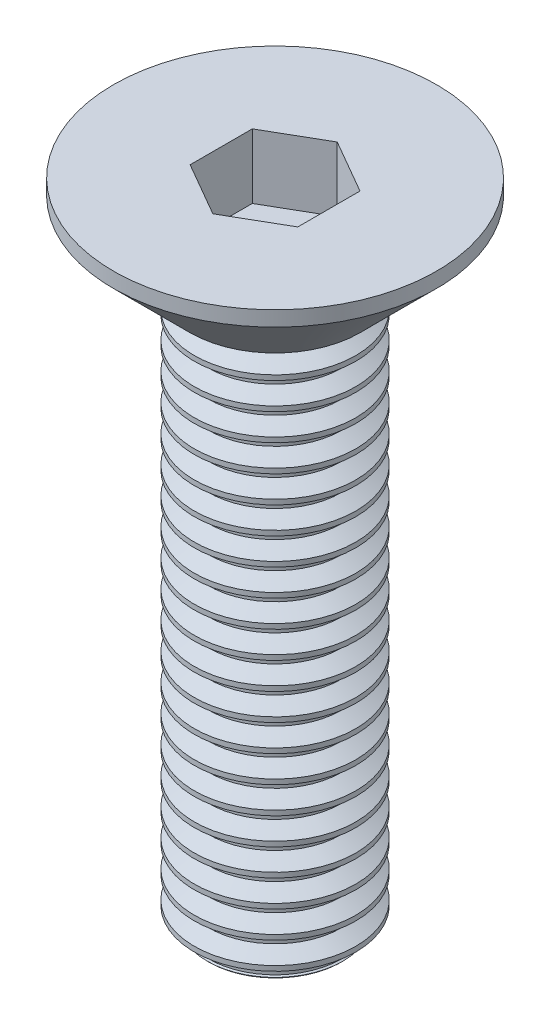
ISO-10303-21;
HEADER;
FILE_DESCRIPTION(('STEP AP214'),'2;1');
FILE_NAME('part.step','',(''),(''),'','','');
FILE_SCHEMA(('AUTOMOTIVE_DESIGN { 1 0 10303 214 1 1 1 1 }'));
ENDSEC;
DATA;
#1=APPLICATION_CONTEXT('core data for automotive mechanical design processes');
#2=APPLICATION_PROTOCOL_DEFINITION('international standard','automotive_design',2000,#1);
#3=PRODUCT_CONTEXT('',#1,'mechanical');
#4=PRODUCT('Part','Part','',(#3));
#5=PRODUCT_RELATED_PRODUCT_CATEGORY('part','',(#4));
#6=PRODUCT_DEFINITION_FORMATION('','',#4);
#7=PRODUCT_DEFINITION_CONTEXT('part definition',#1,'design');
#8=PRODUCT_DEFINITION('design','',#6,#7);
#9=PRODUCT_DEFINITION_SHAPE('','',#8);
#10=(LENGTH_UNIT() NAMED_UNIT(*) SI_UNIT(.MILLI.,.METRE.));
#11=(NAMED_UNIT(*) PLANE_ANGLE_UNIT() SI_UNIT($,.RADIAN.));
#12=(NAMED_UNIT(*) SI_UNIT($,.STERADIAN.) SOLID_ANGLE_UNIT());
#13=UNCERTAINTY_MEASURE_WITH_UNIT(LENGTH_MEASURE(1.E-05),#10,'distance_accuracy_value','');
#14=(GEOMETRIC_REPRESENTATION_CONTEXT(3) GLOBAL_UNCERTAINTY_ASSIGNED_CONTEXT((#13)) GLOBAL_UNIT_ASSIGNED_CONTEXT((#10,
#11,#12)) REPRESENTATION_CONTEXT('',''));
#15=CARTESIAN_POINT('',(0.,0.,0.));
#16=DIRECTION('',(0.,0.,1.));
#17=DIRECTION('',(1.,0.,0.));
#18=AXIS2_PLACEMENT_3D('',#15,#16,#17);
#19=CARTESIAN_POINT('',(0.,0.,0.));
#20=DIRECTION('',(0.,-1.,0.));
#21=DIRECTION('',(1.,0.,0.));
#22=AXIS2_PLACEMENT_3D('',#19,#20,#21);
#23=PLANE('',#22);
#24=DIRECTION('',(0.866025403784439,0.,0.5));
#25=VECTOR('',#24,1.);
#26=CARTESIAN_POINT('',(-1.,0.,0.577350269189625));
#27=LINE('',#26,#25);
#28=CARTESIAN_POINT('',(-1.,0.,0.577350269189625));
#29=VERTEX_POINT('',#28);
#30=CARTESIAN_POINT('',(0.,0.,1.15470053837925));
#31=VERTEX_POINT('',#30);
#32=EDGE_CURVE('E143',#29,#31,#27,.T.);
#33=ORIENTED_EDGE('',*,*,#32,.F.);
#34=DIRECTION('',(0.,0.,1.));
#35=VECTOR('',#34,1.);
#36=CARTESIAN_POINT('',(-1.,0.,-0.577350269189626));
#37=LINE('',#36,#35);
#38=CARTESIAN_POINT('',(-1.,0.,-0.577350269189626));
#39=VERTEX_POINT('',#38);
#40=EDGE_CURVE('E136',#39,#29,#37,.T.);
#41=ORIENTED_EDGE('',*,*,#40,.F.);
#42=DIRECTION('',(-0.866025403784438,0.,0.5));
#43=VECTOR('',#42,1.);
#44=CARTESIAN_POINT('',(0.,0.,-1.15470053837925));
#45=LINE('',#44,#43);
#46=CARTESIAN_POINT('',(0.,0.,-1.15470053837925));
#47=VERTEX_POINT('',#46);
#48=EDGE_CURVE('E131',#47,#39,#45,.T.);
#49=ORIENTED_EDGE('',*,*,#48,.F.);
#50=DIRECTION('',(-0.866025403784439,0.,-0.5));
#51=VECTOR('',#50,1.);
#52=CARTESIAN_POINT('',(1.,0.,-0.577350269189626));
#53=LINE('',#52,#51);
#54=CARTESIAN_POINT('',(1.,0.,-0.577350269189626));
#55=VERTEX_POINT('',#54);
#56=EDGE_CURVE('E110',#55,#47,#53,.T.);
#57=ORIENTED_EDGE('',*,*,#56,.F.);
#58=DIRECTION('',(0.,0.,-1.));
#59=VECTOR('',#58,1.);
#60=CARTESIAN_POINT('',(1.,0.,0.577350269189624));
#61=LINE('',#60,#59);
#62=CARTESIAN_POINT('',(1.,0.,0.577350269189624));
#63=VERTEX_POINT('',#62);
#64=EDGE_CURVE('E122',#63,#55,#61,.T.);
#65=ORIENTED_EDGE('',*,*,#64,.F.);
#66=DIRECTION('',(0.866025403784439,0.,-0.5));
#67=VECTOR('',#66,1.);
#68=CARTESIAN_POINT('',(0.,0.,1.15470053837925));
#69=LINE('',#68,#67);
#70=EDGE_CURVE('E58',#31,#63,#69,.T.);
#71=ORIENTED_EDGE('',*,*,#70,.F.);
#72=EDGE_LOOP('',(#33,#41,#49,#57,#65,#71));
#73=FACE_BOUND('',#72,.T.);
#74=CARTESIAN_POINT('',(0.,0.,0.));
#75=DIRECTION('',(0.,1.,0.));
#76=DIRECTION('',(-1.,0.,0.));
#77=AXIS2_PLACEMENT_3D('',#74,#75,#76);
#78=CIRCLE('',#77,3.);
#79=CARTESIAN_POINT('',(-3.,0.,0.));
#80=VERTEX_POINT('',#79);
#81=EDGE_CURVE('E11',#80,#80,#78,.T.);
#82=ORIENTED_EDGE('',*,*,#81,.T.);
#83=EDGE_LOOP('',(#82));
#84=FACE_BOUND('',#83,.T.);
#85=ADVANCED_FACE('F39',(#73,#84),#23,.F.);
#86=CARTESIAN_POINT('',(0.,0.,0.));
#87=DIRECTION('',(0.,1.,0.));
#88=DIRECTION('',(-1.,0.,0.));
#89=AXIS2_PLACEMENT_3D('',#86,#87,#88);
#90=CYLINDRICAL_SURFACE('',#89,3.);
#91=ORIENTED_EDGE('',*,*,#81,.F.);
#92=EDGE_LOOP('',(#91));
#93=FACE_BOUND('',#92,.T.);
#94=CARTESIAN_POINT('',(0.,-0.28000000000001,0.));
#95=DIRECTION('',(0.,1.,0.));
#96=DIRECTION('',(-1.,0.,0.));
#97=AXIS2_PLACEMENT_3D('',#94,#95,#96);
#98=CIRCLE('',#97,3.);
#99=CARTESIAN_POINT('',(-3.,-0.28000000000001,0.));
#100=VERTEX_POINT('',#99);
#101=EDGE_CURVE('E48',#100,#100,#98,.T.);
#102=ORIENTED_EDGE('',*,*,#101,.T.);
#103=EDGE_LOOP('',(#102));
#104=FACE_BOUND('',#103,.T.);
#105=ADVANCED_FACE('F191',(#93,#104),#90,.T.);
#106=CARTESIAN_POINT('',(0.,-1.69999999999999,0.));
#107=DIRECTION('',(0.,1.,0.));
#108=DIRECTION('',(-1.,0.,0.));
#109=AXIS2_PLACEMENT_3D('',#106,#107,#108);
#110=CONICAL_SURFACE('',#109,1.58000000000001,0.78539816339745);
#111=ORIENTED_EDGE('',*,*,#101,.F.);
#112=EDGE_LOOP('',(#111));
#113=FACE_BOUND('',#112,.T.);
#114=CARTESIAN_POINT('',(0.,-1.69999999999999,0.));
#115=DIRECTION('',(0.,1.,0.));
#116=DIRECTION('',(-1.,0.,0.));
#117=AXIS2_PLACEMENT_3D('',#114,#115,#116);
#118=CIRCLE('',#117,1.58000000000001);
#119=CARTESIAN_POINT('',(-1.58000000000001,-1.69999999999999,0.));
#120=VERTEX_POINT('',#119);
#121=EDGE_CURVE('E182',#120,#120,#118,.T.);
#122=ORIENTED_EDGE('',*,*,#121,.T.);
#123=EDGE_LOOP('',(#122));
#124=FACE_BOUND('',#123,.T.);
#125=ADVANCED_FACE('F193',(#113,#124),#110,.T.);
#126=CARTESIAN_POINT('',(1.50000000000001,-1.69999999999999,0.));
#127=DIRECTION('',(0.,1.,0.));
#128=DIRECTION('',(-1.,0.,0.));
#129=AXIS2_PLACEMENT_3D('',#126,#127,#128);
#130=PLANE('',#129);
#131=ORIENTED_EDGE('',*,*,#121,.F.);
#132=EDGE_LOOP('',(#131));
#133=FACE_BOUND('',#132,.T.);
#134=CARTESIAN_POINT('',(0.,-1.69999999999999,0.));
#135=DIRECTION('',(0.,-1.,0.));
#136=DIRECTION('',(1.,0.,0.));
#137=AXIS2_PLACEMENT_3D('',#134,#135,#136);
#138=CIRCLE('',#137,1.50000000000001);
#139=CARTESIAN_POINT('',(1.50000000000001,-1.69999999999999,0.));
#140=VERTEX_POINT('',#139);
#141=EDGE_CURVE('E206',#140,#140,#138,.T.);
#142=ORIENTED_EDGE('',*,*,#141,.F.);
#143=EDGE_LOOP('',(#142));
#144=FACE_BOUND('',#143,.T.);
#145=ADVANCED_FACE('F196',(#133,#144),#130,.F.);
#146=CARTESIAN_POINT('',(0.,-1.2,1.15470053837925));
#147=DIRECTION('',(0.5,0.,0.866025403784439));
#148=DIRECTION('',(0.866025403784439,0.,-0.5));
#149=AXIS2_PLACEMENT_3D('',#146,#147,#148);
#150=PLANE('',#149);
#151=ORIENTED_EDGE('',*,*,#70,.T.);
#152=DIRECTION('',(0.,1.,0.));
#153=VECTOR('',#152,1.);
#154=CARTESIAN_POINT('',(1.,-1.2,0.577350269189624));
#155=LINE('',#154,#153);
#156=CARTESIAN_POINT('',(1.,-1.2,0.577350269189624));
#157=VERTEX_POINT('',#156);
#158=EDGE_CURVE('E119',#157,#63,#155,.T.);
#159=ORIENTED_EDGE('',*,*,#158,.F.);
#160=DIRECTION('',(0.866025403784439,0.,-0.5));
#161=VECTOR('',#160,1.);
#162=CARTESIAN_POINT('',(0.,-1.2,1.15470053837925));
#163=LINE('',#162,#161);
#164=CARTESIAN_POINT('',(0.,-1.2,1.15470053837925));
#165=VERTEX_POINT('',#164);
#166=EDGE_CURVE('E146',#165,#157,#163,.T.);
#167=ORIENTED_EDGE('',*,*,#166,.F.);
#168=DIRECTION('',(0.,1.,0.));
#169=VECTOR('',#168,1.);
#170=CARTESIAN_POINT('',(0.,-1.2,1.15470053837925));
#171=LINE('',#170,#169);
#172=EDGE_CURVE('E67',#165,#31,#171,.T.);
#173=ORIENTED_EDGE('',*,*,#172,.T.);
#174=EDGE_LOOP('',(#151,#159,#167,#173));
#175=FACE_BOUND('',#174,.T.);
#176=ADVANCED_FACE('F202',(#175),#150,.F.);
#177=CARTESIAN_POINT('',(-1.,-1.2,0.577350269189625));
#178=DIRECTION('',(-0.5,0.,0.866025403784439));
#179=DIRECTION('',(0.866025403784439,0.,0.5));
#180=AXIS2_PLACEMENT_3D('',#177,#178,#179);
#181=PLANE('',#180);
#182=ORIENTED_EDGE('',*,*,#32,.T.);
#183=ORIENTED_EDGE('',*,*,#172,.F.);
#184=DIRECTION('',(0.866025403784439,0.,0.5));
#185=VECTOR('',#184,1.);
#186=CARTESIAN_POINT('',(-1.,-1.2,0.577350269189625));
#187=LINE('',#186,#185);
#188=CARTESIAN_POINT('',(-1.,-1.2,0.577350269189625));
#189=VERTEX_POINT('',#188);
#190=EDGE_CURVE('E163',#189,#165,#187,.T.);
#191=ORIENTED_EDGE('',*,*,#190,.F.);
#192=DIRECTION('',(0.,1.,0.));
#193=VECTOR('',#192,1.);
#194=CARTESIAN_POINT('',(-1.,-1.2,0.577350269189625));
#195=LINE('',#194,#193);
#196=EDGE_CURVE('E170',#189,#29,#195,.T.);
#197=ORIENTED_EDGE('',*,*,#196,.T.);
#198=EDGE_LOOP('',(#182,#183,#191,#197));
#199=FACE_BOUND('',#198,.T.);
#200=ADVANCED_FACE('F279',(#199),#181,.F.);
#201=CARTESIAN_POINT('',(-1.,-1.2,-0.577350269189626));
#202=DIRECTION('',(-1.,0.,0.));
#203=DIRECTION('',(0.,0.,1.));
#204=AXIS2_PLACEMENT_3D('',#201,#202,#203);
#205=PLANE('',#204);
#206=ORIENTED_EDGE('',*,*,#40,.T.);
#207=ORIENTED_EDGE('',*,*,#196,.F.);
#208=DIRECTION('',(0.,0.,1.));
#209=VECTOR('',#208,1.);
#210=CARTESIAN_POINT('',(-1.,-1.2,-0.577350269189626));
#211=LINE('',#210,#209);
#212=CARTESIAN_POINT('',(-1.,-1.2,-0.577350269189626));
#213=VERTEX_POINT('',#212);
#214=EDGE_CURVE('E159',#213,#189,#211,.T.);
#215=ORIENTED_EDGE('',*,*,#214,.F.);
#216=DIRECTION('',(0.,1.,0.));
#217=VECTOR('',#216,1.);
#218=CARTESIAN_POINT('',(-1.,-1.2,-0.577350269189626));
#219=LINE('',#218,#217);
#220=EDGE_CURVE('E173',#213,#39,#219,.T.);
#221=ORIENTED_EDGE('',*,*,#220,.T.);
#222=EDGE_LOOP('',(#206,#207,#215,#221));
#223=FACE_BOUND('',#222,.T.);
#224=ADVANCED_FACE('F287',(#223),#205,.F.);
#225=CARTESIAN_POINT('',(0.,-1.2,-1.15470053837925));
#226=DIRECTION('',(-0.5,0.,-0.866025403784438));
#227=DIRECTION('',(-0.866025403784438,0.,0.5));
#228=AXIS2_PLACEMENT_3D('',#225,#226,#227);
#229=PLANE('',#228);
#230=ORIENTED_EDGE('',*,*,#48,.T.);
#231=ORIENTED_EDGE('',*,*,#220,.F.);
#232=DIRECTION('',(-0.866025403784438,0.,0.5));
#233=VECTOR('',#232,1.);
#234=CARTESIAN_POINT('',(0.,-1.2,-1.15470053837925));
#235=LINE('',#234,#233);
#236=CARTESIAN_POINT('',(0.,-1.2,-1.15470053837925));
#237=VERTEX_POINT('',#236);
#238=EDGE_CURVE('E155',#237,#213,#235,.T.);
#239=ORIENTED_EDGE('',*,*,#238,.F.);
#240=DIRECTION('',(0.,1.,0.));
#241=VECTOR('',#240,1.);
#242=CARTESIAN_POINT('',(0.,-1.2,-1.15470053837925));
#243=LINE('',#242,#241);
#244=EDGE_CURVE('E118',#237,#47,#243,.T.);
#245=ORIENTED_EDGE('',*,*,#244,.T.);
#246=EDGE_LOOP('',(#230,#231,#239,#245));
#247=FACE_BOUND('',#246,.T.);
#248=ADVANCED_FACE('F284',(#247),#229,.F.);
#249=CARTESIAN_POINT('',(1.,-1.2,-0.577350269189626));
#250=DIRECTION('',(0.5,0.,-0.866025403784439));
#251=DIRECTION('',(-0.866025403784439,0.,-0.5));
#252=AXIS2_PLACEMENT_3D('',#249,#250,#251);
#253=PLANE('',#252);
#254=ORIENTED_EDGE('',*,*,#56,.T.);
#255=ORIENTED_EDGE('',*,*,#244,.F.);
#256=DIRECTION('',(-0.866025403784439,0.,-0.5));
#257=VECTOR('',#256,1.);
#258=CARTESIAN_POINT('',(1.,-1.2,-0.577350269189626));
#259=LINE('',#258,#257);
#260=CARTESIAN_POINT('',(1.,-1.2,-0.577350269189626));
#261=VERTEX_POINT('',#260);
#262=EDGE_CURVE('E113',#261,#237,#259,.T.);
#263=ORIENTED_EDGE('',*,*,#262,.F.);
#264=DIRECTION('',(0.,1.,0.));
#265=VECTOR('',#264,1.);
#266=CARTESIAN_POINT('',(1.,-1.2,-0.577350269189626));
#267=LINE('',#266,#265);
#268=EDGE_CURVE('E106',#261,#55,#267,.T.);
#269=ORIENTED_EDGE('',*,*,#268,.T.);
#270=EDGE_LOOP('',(#254,#255,#263,#269));
#271=FACE_BOUND('',#270,.T.);
#272=ADVANCED_FACE('F108',(#271),#253,.F.);
#273=CARTESIAN_POINT('',(1.,-1.2,0.577350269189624));
#274=DIRECTION('',(1.,0.,0.));
#275=DIRECTION('',(0.,0.,-1.));
#276=AXIS2_PLACEMENT_3D('',#273,#274,#275);
#277=PLANE('',#276);
#278=ORIENTED_EDGE('',*,*,#64,.T.);
#279=ORIENTED_EDGE('',*,*,#268,.F.);
#280=DIRECTION('',(0.,0.,-1.));
#281=VECTOR('',#280,1.);
#282=CARTESIAN_POINT('',(1.,-1.2,0.577350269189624));
#283=LINE('',#282,#281);
#284=EDGE_CURVE('E150',#157,#261,#283,.T.);
#285=ORIENTED_EDGE('',*,*,#284,.F.);
#286=ORIENTED_EDGE('',*,*,#158,.T.);
#287=EDGE_LOOP('',(#278,#279,#285,#286));
#288=FACE_BOUND('',#287,.T.);
#289=ADVANCED_FACE('F123',(#288),#277,.F.);
#290=CARTESIAN_POINT('',(-1.,-1.2,1.73205080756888));
#291=DIRECTION('',(0.,-1.,0.));
#292=DIRECTION('',(0.,0.,-1.));
#293=AXIS2_PLACEMENT_3D('',#290,#291,#292);
#294=PLANE('',#293);
#295=ORIENTED_EDGE('',*,*,#166,.T.);
#296=ORIENTED_EDGE('',*,*,#284,.T.);
#297=ORIENTED_EDGE('',*,*,#262,.T.);
#298=ORIENTED_EDGE('',*,*,#238,.T.);
#299=ORIENTED_EDGE('',*,*,#214,.T.);
#300=ORIENTED_EDGE('',*,*,#190,.T.);
#301=EDGE_LOOP('',(#295,#296,#297,#298,#299,#300));
#302=FACE_BOUND('',#301,.T.);
#303=ADVANCED_FACE('F238',(#302),#294,.F.);
#304=CARTESIAN_POINT('',(0.,-1.95000000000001,0.));
#305=DIRECTION('',(0.,-1.,0.));
#306=DIRECTION('',(1.,0.,0.));
#307=AXIS2_PLACEMENT_3D('',#304,#305,#306);
#308=CONICAL_SURFACE('',#307,1.22698729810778,1.04719755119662);
#309=CARTESIAN_POINT('',(0.,-2.10762395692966,0.));
#310=DIRECTION('',(0.,-1.,0.));
#311=DIRECTION('',(1.,0.,0.));
#312=AXIS2_PLACEMENT_3D('',#309,#310,#311);
#313=CIRCLE('',#312,1.50000000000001);
#314=CARTESIAN_POINT('',(1.50000000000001,-2.10762395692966,0.));
#315=VERTEX_POINT('',#314);
#316=EDGE_CURVE('E225',#315,#315,#313,.T.);
#317=ORIENTED_EDGE('',*,*,#316,.F.);
#318=EDGE_LOOP('',(#317));
#319=FACE_BOUND('',#318,.T.);
#320=CARTESIAN_POINT('',(0.,-1.95000000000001,0.));
#321=DIRECTION('',(0.,-1.,0.));
#322=DIRECTION('',(1.,0.,0.));
#323=AXIS2_PLACEMENT_3D('',#320,#321,#322);
#324=CIRCLE('',#323,1.22698729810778);
#325=CARTESIAN_POINT('',(1.22698729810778,-1.95000000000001,0.));
#326=VERTEX_POINT('',#325);
#327=EDGE_CURVE('E214',#326,#326,#324,.T.);
#328=ORIENTED_EDGE('',*,*,#327,.T.);
#329=EDGE_LOOP('',(#328));
#330=FACE_BOUND('',#329,.T.);
#331=ADVANCED_FACE('F234',(#319,#330),#308,.T.);
#332=CARTESIAN_POINT('',(0.,-12.,0.));
#333=DIRECTION('',(0.,-1.,0.));
#334=DIRECTION('',(1.,0.,0.));
#335=AXIS2_PLACEMENT_3D('',#332,#333,#334);
#336=CYLINDRICAL_SURFACE('',#335,1.22698729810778);
#337=ORIENTED_EDGE('',*,*,#327,.F.);
#338=EDGE_LOOP('',(#337));
#339=FACE_BOUND('',#338,.T.);
#340=CARTESIAN_POINT('',(0.,-1.85762395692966,0.));
#341=DIRECTION('',(0.,-1.,0.));
#342=DIRECTION('',(1.,0.,0.));
#343=AXIS2_PLACEMENT_3D('',#340,#341,#342);
#344=CIRCLE('',#343,1.22698729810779);
#345=CARTESIAN_POINT('',(1.22698729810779,-1.85762395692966,0.));
#346=VERTEX_POINT('',#345);
#347=EDGE_CURVE('E209',#346,#346,#344,.T.);
#348=ORIENTED_EDGE('',*,*,#347,.T.);
#349=EDGE_LOOP('',(#348));
#350=FACE_BOUND('',#349,.T.);
#351=ADVANCED_FACE('F237',(#339,#350),#336,.T.);
#352=CARTESIAN_POINT('',(0.,-1.69999999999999,0.));
#353=DIRECTION('',(0.,1.,0.));
#354=DIRECTION('',(-1.,0.,0.));
#355=AXIS2_PLACEMENT_3D('',#352,#353,#354);
#356=CONICAL_SURFACE('',#355,1.50000000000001,1.04719755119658);
#357=ORIENTED_EDGE('',*,*,#347,.F.);
#358=EDGE_LOOP('',(#357));
#359=FACE_BOUND('',#358,.T.);
#360=ORIENTED_EDGE('',*,*,#141,.T.);
#361=EDGE_LOOP('',(#360));
#362=FACE_BOUND('',#361,.T.);
#363=ADVANCED_FACE('F244',(#359,#362),#356,.T.);
#364=CARTESIAN_POINT('',(0.,0.,0.));
#365=DIRECTION('',(0.,1.,0.));
#366=DIRECTION('',(-1.,0.,0.));
#367=AXIS2_PLACEMENT_3D('',#364,#365,#366);
#368=CYLINDRICAL_SURFACE('',#367,1.5);
#369=CARTESIAN_POINT('',(0.,-2.19999999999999,0.));
#370=DIRECTION('',(0.,-1.,0.));
#371=DIRECTION('',(1.,0.,0.));
#372=AXIS2_PLACEMENT_3D('',#369,#370,#371);
#373=CIRCLE('',#372,1.50000000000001);
#374=CARTESIAN_POINT('',(1.50000000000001,-2.19999999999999,0.));
#375=VERTEX_POINT('',#374);
#376=EDGE_CURVE('E1470',#375,#375,#373,.T.);
#377=ORIENTED_EDGE('',*,*,#376,.F.);
#378=EDGE_LOOP('',(#377));
#379=FACE_BOUND('',#378,.T.);
#380=ORIENTED_EDGE('',*,*,#316,.T.);
#381=EDGE_LOOP('',(#380));
#382=FACE_BOUND('',#381,.T.);
#383=ADVANCED_FACE('F232',(#379,#382),#368,.T.);
#384=CARTESIAN_POINT('',(0.,-2.45000000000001,0.));
#385=DIRECTION('',(0.,-1.,0.));
#386=DIRECTION('',(1.,0.,0.));
#387=AXIS2_PLACEMENT_3D('',#384,#385,#386);
#388=CONICAL_SURFACE('',#387,1.22698729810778,1.04719755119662);
#389=CARTESIAN_POINT('',(0.,-2.60762395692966,0.));
#390=DIRECTION('',(0.,-1.,0.));
#391=DIRECTION('',(1.,0.,0.));
#392=AXIS2_PLACEMENT_3D('',#389,#390,#391);
#393=CIRCLE('',#392,1.50000000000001);
#394=CARTESIAN_POINT('',(1.50000000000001,-2.60762395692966,0.));
#395=VERTEX_POINT('',#394);
#396=EDGE_CURVE('E210',#395,#395,#393,.T.);
#397=ORIENTED_EDGE('',*,*,#396,.F.);
#398=EDGE_LOOP('',(#397));
#399=FACE_BOUND('',#398,.T.);
#400=CARTESIAN_POINT('',(0.,-2.45000000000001,0.));
#401=DIRECTION('',(0.,-1.,0.));
#402=DIRECTION('',(1.,0.,0.));
#403=AXIS2_PLACEMENT_3D('',#400,#401,#402);
#404=CIRCLE('',#403,1.22698729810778);
#405=CARTESIAN_POINT('',(1.22698729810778,-2.45000000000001,0.));
#406=VERTEX_POINT('',#405);
#407=EDGE_CURVE('E218',#406,#406,#404,.T.);
#408=ORIENTED_EDGE('',*,*,#407,.T.);
#409=EDGE_LOOP('',(#408));
#410=FACE_BOUND('',#409,.T.);
#411=ADVANCED_FACE('F253',(#399,#410),#388,.T.);
#412=CARTESIAN_POINT('',(0.,-12.5,0.));
#413=DIRECTION('',(0.,-1.,0.));
#414=DIRECTION('',(1.,0.,0.));
#415=AXIS2_PLACEMENT_3D('',#412,#413,#414);
#416=CYLINDRICAL_SURFACE('',#415,1.22698729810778);
#417=ORIENTED_EDGE('',*,*,#407,.F.);
#418=EDGE_LOOP('',(#417));
#419=FACE_BOUND('',#418,.T.);
#420=CARTESIAN_POINT('',(0.,-2.35762395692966,0.));
#421=DIRECTION('',(0.,-1.,0.));
#422=DIRECTION('',(1.,0.,0.));
#423=AXIS2_PLACEMENT_3D('',#420,#421,#422);
#424=CIRCLE('',#423,1.22698729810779);
#425=CARTESIAN_POINT('',(1.22698729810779,-2.35762395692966,0.));
#426=VERTEX_POINT('',#425);
#427=EDGE_CURVE('E1473',#426,#426,#424,.T.);
#428=ORIENTED_EDGE('',*,*,#427,.T.);
#429=EDGE_LOOP('',(#428));
#430=FACE_BOUND('',#429,.T.);
#431=ADVANCED_FACE('F336',(#419,#430),#416,.T.);
#432=CARTESIAN_POINT('',(0.,-2.19999999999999,0.));
#433=DIRECTION('',(0.,1.,0.));
#434=DIRECTION('',(-1.,0.,0.));
#435=AXIS2_PLACEMENT_3D('',#432,#433,#434);
#436=CONICAL_SURFACE('',#435,1.50000000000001,1.04719755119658);
#437=ORIENTED_EDGE('',*,*,#427,.F.);
#438=EDGE_LOOP('',(#437));
#439=FACE_BOUND('',#438,.T.);
#440=ORIENTED_EDGE('',*,*,#376,.T.);
#441=EDGE_LOOP('',(#440));
#442=FACE_BOUND('',#441,.T.);
#443=ADVANCED_FACE('F346',(#439,#442),#436,.T.);
#444=CARTESIAN_POINT('',(0.,-2.69999999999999,0.));
#445=DIRECTION('',(0.,-1.,0.));
#446=DIRECTION('',(1.,0.,0.));
#447=AXIS2_PLACEMENT_3D('',#444,#445,#446);
#448=CIRCLE('',#447,1.50000000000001);
#449=CARTESIAN_POINT('',(1.50000000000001,-2.69999999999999,0.));
#450=VERTEX_POINT('',#449);
#451=EDGE_CURVE('E1454',#450,#450,#448,.T.);
#452=ORIENTED_EDGE('',*,*,#451,.F.);
#453=EDGE_LOOP('',(#452));
#454=FACE_BOUND('',#453,.T.);
#455=ORIENTED_EDGE('',*,*,#396,.T.);
#456=EDGE_LOOP('',(#455));
#457=FACE_BOUND('',#456,.T.);
#458=ADVANCED_FACE('F257',(#454,#457),#368,.T.);
#459=CARTESIAN_POINT('',(0.,-2.95000000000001,0.));
#460=DIRECTION('',(0.,-1.,0.));
#461=DIRECTION('',(1.,0.,0.));
#462=AXIS2_PLACEMENT_3D('',#459,#460,#461);
#463=CONICAL_SURFACE('',#462,1.22698729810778,1.04719755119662);
#464=CARTESIAN_POINT('',(0.,-3.10762395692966,0.));
#465=DIRECTION('',(0.,-1.,0.));
#466=DIRECTION('',(1.,0.,0.));
#467=AXIS2_PLACEMENT_3D('',#464,#465,#466);
#468=CIRCLE('',#467,1.50000000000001);
#469=CARTESIAN_POINT('',(1.50000000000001,-3.10762395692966,0.));
#470=VERTEX_POINT('',#469);
#471=EDGE_CURVE('E1466',#470,#470,#468,.T.);
#472=ORIENTED_EDGE('',*,*,#471,.F.);
#473=EDGE_LOOP('',(#472));
#474=FACE_BOUND('',#473,.T.);
#475=CARTESIAN_POINT('',(0.,-2.95000000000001,0.));
#476=DIRECTION('',(0.,-1.,0.));
#477=DIRECTION('',(1.,0.,0.));
#478=AXIS2_PLACEMENT_3D('',#475,#476,#477);
#479=CIRCLE('',#478,1.22698729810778);
#480=CARTESIAN_POINT('',(1.22698729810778,-2.95000000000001,0.));
#481=VERTEX_POINT('',#480);
#482=EDGE_CURVE('E1462',#481,#481,#479,.T.);
#483=ORIENTED_EDGE('',*,*,#482,.T.);
#484=EDGE_LOOP('',(#483));
#485=FACE_BOUND('',#484,.T.);
#486=ADVANCED_FACE('F366',(#474,#485),#463,.T.);
#487=CARTESIAN_POINT('',(0.,-13.,0.));
#488=DIRECTION('',(0.,-1.,0.));
#489=DIRECTION('',(1.,0.,0.));
#490=AXIS2_PLACEMENT_3D('',#487,#488,#489);
#491=CYLINDRICAL_SURFACE('',#490,1.22698729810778);
#492=ORIENTED_EDGE('',*,*,#482,.F.);
#493=EDGE_LOOP('',(#492));
#494=FACE_BOUND('',#493,.T.);
#495=CARTESIAN_POINT('',(0.,-2.85762395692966,0.));
#496=DIRECTION('',(0.,-1.,0.));
#497=DIRECTION('',(1.,0.,0.));
#498=AXIS2_PLACEMENT_3D('',#495,#496,#497);
#499=CIRCLE('',#498,1.22698729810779);
#500=CARTESIAN_POINT('',(1.22698729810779,-2.85762395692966,0.));
#501=VERTEX_POINT('',#500);
#502=EDGE_CURVE('E1458',#501,#501,#499,.T.);
#503=ORIENTED_EDGE('',*,*,#502,.T.);
#504=EDGE_LOOP('',(#503));
#505=FACE_BOUND('',#504,.T.);
#506=ADVANCED_FACE('F376',(#494,#505),#491,.T.);
#507=CARTESIAN_POINT('',(0.,-2.69999999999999,0.));
#508=DIRECTION('',(0.,1.,0.));
#509=DIRECTION('',(-1.,0.,0.));
#510=AXIS2_PLACEMENT_3D('',#507,#508,#509);
#511=CONICAL_SURFACE('',#510,1.50000000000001,1.04719755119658);
#512=ORIENTED_EDGE('',*,*,#502,.F.);
#513=EDGE_LOOP('',(#512));
#514=FACE_BOUND('',#513,.T.);
#515=ORIENTED_EDGE('',*,*,#451,.T.);
#516=EDGE_LOOP('',(#515));
#517=FACE_BOUND('',#516,.T.);
#518=ADVANCED_FACE('F386',(#514,#517),#511,.T.);
#519=CARTESIAN_POINT('',(0.,-3.19999999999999,0.));
#520=DIRECTION('',(0.,-1.,0.));
#521=DIRECTION('',(1.,0.,0.));
#522=AXIS2_PLACEMENT_3D('',#519,#520,#521);
#523=CIRCLE('',#522,1.50000000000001);
#524=CARTESIAN_POINT('',(1.50000000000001,-3.19999999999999,0.));
#525=VERTEX_POINT('',#524);
#526=EDGE_CURVE('E1438',#525,#525,#523,.T.);
#527=ORIENTED_EDGE('',*,*,#526,.F.);
#528=EDGE_LOOP('',(#527));
#529=FACE_BOUND('',#528,.T.);
#530=ORIENTED_EDGE('',*,*,#471,.T.);
#531=EDGE_LOOP('',(#530));
#532=FACE_BOUND('',#531,.T.);
#533=ADVANCED_FACE('F368',(#529,#532),#368,.T.);
#534=CARTESIAN_POINT('',(0.,-3.45000000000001,0.));
#535=DIRECTION('',(0.,-1.,0.));
#536=DIRECTION('',(1.,0.,0.));
#537=AXIS2_PLACEMENT_3D('',#534,#535,#536);
#538=CONICAL_SURFACE('',#537,1.22698729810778,1.04719755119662);
#539=CARTESIAN_POINT('',(0.,-3.60762395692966,0.));
#540=DIRECTION('',(0.,-1.,0.));
#541=DIRECTION('',(1.,0.,0.));
#542=AXIS2_PLACEMENT_3D('',#539,#540,#541);
#543=CIRCLE('',#542,1.50000000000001);
#544=CARTESIAN_POINT('',(1.50000000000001,-3.60762395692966,0.));
#545=VERTEX_POINT('',#544);
#546=EDGE_CURVE('E1450',#545,#545,#543,.T.);
#547=ORIENTED_EDGE('',*,*,#546,.F.);
#548=EDGE_LOOP('',(#547));
#549=FACE_BOUND('',#548,.T.);
#550=CARTESIAN_POINT('',(0.,-3.45000000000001,0.));
#551=DIRECTION('',(0.,-1.,0.));
#552=DIRECTION('',(1.,0.,0.));
#553=AXIS2_PLACEMENT_3D('',#550,#551,#552);
#554=CIRCLE('',#553,1.22698729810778);
#555=CARTESIAN_POINT('',(1.22698729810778,-3.45000000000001,0.));
#556=VERTEX_POINT('',#555);
#557=EDGE_CURVE('E1446',#556,#556,#554,.T.);
#558=ORIENTED_EDGE('',*,*,#557,.T.);
#559=EDGE_LOOP('',(#558));
#560=FACE_BOUND('',#559,.T.);
#561=ADVANCED_FACE('F405',(#549,#560),#538,.T.);
#562=CARTESIAN_POINT('',(0.,-13.5,0.));
#563=DIRECTION('',(0.,-1.,0.));
#564=DIRECTION('',(1.,0.,0.));
#565=AXIS2_PLACEMENT_3D('',#562,#563,#564);
#566=CYLINDRICAL_SURFACE('',#565,1.22698729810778);
#567=ORIENTED_EDGE('',*,*,#557,.F.);
#568=EDGE_LOOP('',(#567));
#569=FACE_BOUND('',#568,.T.);
#570=CARTESIAN_POINT('',(0.,-3.35762395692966,0.));
#571=DIRECTION('',(0.,-1.,0.));
#572=DIRECTION('',(1.,0.,0.));
#573=AXIS2_PLACEMENT_3D('',#570,#571,#572);
#574=CIRCLE('',#573,1.22698729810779);
#575=CARTESIAN_POINT('',(1.22698729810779,-3.35762395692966,0.));
#576=VERTEX_POINT('',#575);
#577=EDGE_CURVE('E1442',#576,#576,#574,.T.);
#578=ORIENTED_EDGE('',*,*,#577,.T.);
#579=EDGE_LOOP('',(#578));
#580=FACE_BOUND('',#579,.T.);
#581=ADVANCED_FACE('F416',(#569,#580),#566,.T.);
#582=CARTESIAN_POINT('',(0.,-3.19999999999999,0.));
#583=DIRECTION('',(0.,1.,0.));
#584=DIRECTION('',(-1.,0.,0.));
#585=AXIS2_PLACEMENT_3D('',#582,#583,#584);
#586=CONICAL_SURFACE('',#585,1.50000000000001,1.04719755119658);
#587=ORIENTED_EDGE('',*,*,#577,.F.);
#588=EDGE_LOOP('',(#587));
#589=FACE_BOUND('',#588,.T.);
#590=ORIENTED_EDGE('',*,*,#526,.T.);
#591=EDGE_LOOP('',(#590));
#592=FACE_BOUND('',#591,.T.);
#593=ADVANCED_FACE('F426',(#589,#592),#586,.T.);
#594=CARTESIAN_POINT('',(0.,-3.69999999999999,0.));
#595=DIRECTION('',(0.,-1.,0.));
#596=DIRECTION('',(1.,0.,0.));
#597=AXIS2_PLACEMENT_3D('',#594,#595,#596);
#598=CIRCLE('',#597,1.50000000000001);
#599=CARTESIAN_POINT('',(1.50000000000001,-3.69999999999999,0.));
#600=VERTEX_POINT('',#599);
#601=EDGE_CURVE('E1422',#600,#600,#598,.T.);
#602=ORIENTED_EDGE('',*,*,#601,.F.);
#603=EDGE_LOOP('',(#602));
#604=FACE_BOUND('',#603,.T.);
#605=ORIENTED_EDGE('',*,*,#546,.T.);
#606=EDGE_LOOP('',(#605));
#607=FACE_BOUND('',#606,.T.);
#608=ADVANCED_FACE('F407',(#604,#607),#368,.T.);
#609=CARTESIAN_POINT('',(0.,-3.95000000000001,0.));
#610=DIRECTION('',(0.,-1.,0.));
#611=DIRECTION('',(1.,0.,0.));
#612=AXIS2_PLACEMENT_3D('',#609,#610,#611);
#613=CONICAL_SURFACE('',#612,1.22698729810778,1.04719755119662);
#614=CARTESIAN_POINT('',(0.,-4.10762395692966,0.));
#615=DIRECTION('',(0.,-1.,0.));
#616=DIRECTION('',(1.,0.,0.));
#617=AXIS2_PLACEMENT_3D('',#614,#615,#616);
#618=CIRCLE('',#617,1.50000000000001);
#619=CARTESIAN_POINT('',(1.50000000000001,-4.10762395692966,0.));
#620=VERTEX_POINT('',#619);
#621=EDGE_CURVE('E1434',#620,#620,#618,.T.);
#622=ORIENTED_EDGE('',*,*,#621,.F.);
#623=EDGE_LOOP('',(#622));
#624=FACE_BOUND('',#623,.T.);
#625=CARTESIAN_POINT('',(0.,-3.95000000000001,0.));
#626=DIRECTION('',(0.,-1.,0.));
#627=DIRECTION('',(1.,0.,0.));
#628=AXIS2_PLACEMENT_3D('',#625,#626,#627);
#629=CIRCLE('',#628,1.22698729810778);
#630=CARTESIAN_POINT('',(1.22698729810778,-3.95000000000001,0.));
#631=VERTEX_POINT('',#630);
#632=EDGE_CURVE('E1430',#631,#631,#629,.T.);
#633=ORIENTED_EDGE('',*,*,#632,.T.);
#634=EDGE_LOOP('',(#633));
#635=FACE_BOUND('',#634,.T.);
#636=ADVANCED_FACE('F444',(#624,#635),#613,.T.);
#637=CARTESIAN_POINT('',(0.,-14.,0.));
#638=DIRECTION('',(0.,-1.,0.));
#639=DIRECTION('',(1.,0.,0.));
#640=AXIS2_PLACEMENT_3D('',#637,#638,#639);
#641=CYLINDRICAL_SURFACE('',#640,1.22698729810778);
#642=ORIENTED_EDGE('',*,*,#632,.F.);
#643=EDGE_LOOP('',(#642));
#644=FACE_BOUND('',#643,.T.);
#645=CARTESIAN_POINT('',(0.,-3.85762395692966,0.));
#646=DIRECTION('',(0.,-1.,0.));
#647=DIRECTION('',(1.,0.,0.));
#648=AXIS2_PLACEMENT_3D('',#645,#646,#647);
#649=CIRCLE('',#648,1.22698729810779);
#650=CARTESIAN_POINT('',(1.22698729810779,-3.85762395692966,0.));
#651=VERTEX_POINT('',#650);
#652=EDGE_CURVE('E1426',#651,#651,#649,.T.);
#653=ORIENTED_EDGE('',*,*,#652,.T.);
#654=EDGE_LOOP('',(#653));
#655=FACE_BOUND('',#654,.T.);
#656=ADVANCED_FACE('F454',(#644,#655),#641,.T.);
#657=CARTESIAN_POINT('',(0.,-3.69999999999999,0.));
#658=DIRECTION('',(0.,1.,0.));
#659=DIRECTION('',(-1.,0.,0.));
#660=AXIS2_PLACEMENT_3D('',#657,#658,#659);
#661=CONICAL_SURFACE('',#660,1.50000000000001,1.04719755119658);
#662=ORIENTED_EDGE('',*,*,#652,.F.);
#663=EDGE_LOOP('',(#662));
#664=FACE_BOUND('',#663,.T.);
#665=ORIENTED_EDGE('',*,*,#601,.T.);
#666=EDGE_LOOP('',(#665));
#667=FACE_BOUND('',#666,.T.);
#668=ADVANCED_FACE('F464',(#664,#667),#661,.T.);
#669=CARTESIAN_POINT('',(0.,-4.19999999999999,0.));
#670=DIRECTION('',(0.,-1.,0.));
#671=DIRECTION('',(1.,0.,0.));
#672=AXIS2_PLACEMENT_3D('',#669,#670,#671);
#673=CIRCLE('',#672,1.50000000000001);
#674=CARTESIAN_POINT('',(1.50000000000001,-4.19999999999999,0.));
#675=VERTEX_POINT('',#674);
#676=EDGE_CURVE('E1406',#675,#675,#673,.T.);
#677=ORIENTED_EDGE('',*,*,#676,.F.);
#678=EDGE_LOOP('',(#677));
#679=FACE_BOUND('',#678,.T.);
#680=ORIENTED_EDGE('',*,*,#621,.T.);
#681=EDGE_LOOP('',(#680));
#682=FACE_BOUND('',#681,.T.);
#683=ADVANCED_FACE('F446',(#679,#682),#368,.T.);
#684=CARTESIAN_POINT('',(0.,-4.45000000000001,0.));
#685=DIRECTION('',(0.,-1.,0.));
#686=DIRECTION('',(1.,0.,0.));
#687=AXIS2_PLACEMENT_3D('',#684,#685,#686);
#688=CONICAL_SURFACE('',#687,1.22698729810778,1.04719755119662);
#689=CARTESIAN_POINT('',(0.,-4.60762395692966,0.));
#690=DIRECTION('',(0.,-1.,0.));
#691=DIRECTION('',(1.,0.,0.));
#692=AXIS2_PLACEMENT_3D('',#689,#690,#691);
#693=CIRCLE('',#692,1.50000000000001);
#694=CARTESIAN_POINT('',(1.50000000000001,-4.60762395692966,0.));
#695=VERTEX_POINT('',#694);
#696=EDGE_CURVE('E1418',#695,#695,#693,.T.);
#697=ORIENTED_EDGE('',*,*,#696,.F.);
#698=EDGE_LOOP('',(#697));
#699=FACE_BOUND('',#698,.T.);
#700=CARTESIAN_POINT('',(0.,-4.45000000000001,0.));
#701=DIRECTION('',(0.,-1.,0.));
#702=DIRECTION('',(1.,0.,0.));
#703=AXIS2_PLACEMENT_3D('',#700,#701,#702);
#704=CIRCLE('',#703,1.22698729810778);
#705=CARTESIAN_POINT('',(1.22698729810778,-4.45000000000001,0.));
#706=VERTEX_POINT('',#705);
#707=EDGE_CURVE('E1414',#706,#706,#704,.T.);
#708=ORIENTED_EDGE('',*,*,#707,.T.);
#709=EDGE_LOOP('',(#708));
#710=FACE_BOUND('',#709,.T.);
#711=ADVANCED_FACE('F482',(#699,#710),#688,.T.);
#712=CARTESIAN_POINT('',(0.,-14.5,0.));
#713=DIRECTION('',(0.,-1.,0.));
#714=DIRECTION('',(1.,0.,0.));
#715=AXIS2_PLACEMENT_3D('',#712,#713,#714);
#716=CYLINDRICAL_SURFACE('',#715,1.22698729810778);
#717=ORIENTED_EDGE('',*,*,#707,.F.);
#718=EDGE_LOOP('',(#717));
#719=FACE_BOUND('',#718,.T.);
#720=CARTESIAN_POINT('',(0.,-4.35762395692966,0.));
#721=DIRECTION('',(0.,-1.,0.));
#722=DIRECTION('',(1.,0.,0.));
#723=AXIS2_PLACEMENT_3D('',#720,#721,#722);
#724=CIRCLE('',#723,1.22698729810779);
#725=CARTESIAN_POINT('',(1.22698729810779,-4.35762395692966,0.));
#726=VERTEX_POINT('',#725);
#727=EDGE_CURVE('E1410',#726,#726,#724,.T.);
#728=ORIENTED_EDGE('',*,*,#727,.T.);
#729=EDGE_LOOP('',(#728));
#730=FACE_BOUND('',#729,.T.);
#731=ADVANCED_FACE('F492',(#719,#730),#716,.T.);
#732=CARTESIAN_POINT('',(0.,-4.19999999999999,0.));
#733=DIRECTION('',(0.,1.,0.));
#734=DIRECTION('',(-1.,0.,0.));
#735=AXIS2_PLACEMENT_3D('',#732,#733,#734);
#736=CONICAL_SURFACE('',#735,1.50000000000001,1.04719755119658);
#737=ORIENTED_EDGE('',*,*,#727,.F.);
#738=EDGE_LOOP('',(#737));
#739=FACE_BOUND('',#738,.T.);
#740=ORIENTED_EDGE('',*,*,#676,.T.);
#741=EDGE_LOOP('',(#740));
#742=FACE_BOUND('',#741,.T.);
#743=ADVANCED_FACE('F502',(#739,#742),#736,.T.);
#744=CARTESIAN_POINT('',(0.,-4.69999999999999,0.));
#745=DIRECTION('',(0.,-1.,0.));
#746=DIRECTION('',(1.,0.,0.));
#747=AXIS2_PLACEMENT_3D('',#744,#745,#746);
#748=CIRCLE('',#747,1.50000000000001);
#749=CARTESIAN_POINT('',(1.50000000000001,-4.69999999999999,0.));
#750=VERTEX_POINT('',#749);
#751=EDGE_CURVE('E1390',#750,#750,#748,.T.);
#752=ORIENTED_EDGE('',*,*,#751,.F.);
#753=EDGE_LOOP('',(#752));
#754=FACE_BOUND('',#753,.T.);
#755=ORIENTED_EDGE('',*,*,#696,.T.);
#756=EDGE_LOOP('',(#755));
#757=FACE_BOUND('',#756,.T.);
#758=ADVANCED_FACE('F484',(#754,#757),#368,.T.);
#759=CARTESIAN_POINT('',(0.,-4.95000000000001,0.));
#760=DIRECTION('',(0.,-1.,0.));
#761=DIRECTION('',(1.,0.,0.));
#762=AXIS2_PLACEMENT_3D('',#759,#760,#761);
#763=CONICAL_SURFACE('',#762,1.22698729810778,1.04719755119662);
#764=CARTESIAN_POINT('',(0.,-5.10762395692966,0.));
#765=DIRECTION('',(0.,-1.,0.));
#766=DIRECTION('',(1.,0.,0.));
#767=AXIS2_PLACEMENT_3D('',#764,#765,#766);
#768=CIRCLE('',#767,1.50000000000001);
#769=CARTESIAN_POINT('',(1.50000000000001,-5.10762395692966,0.));
#770=VERTEX_POINT('',#769);
#771=EDGE_CURVE('E1402',#770,#770,#768,.T.);
#772=ORIENTED_EDGE('',*,*,#771,.F.);
#773=EDGE_LOOP('',(#772));
#774=FACE_BOUND('',#773,.T.);
#775=CARTESIAN_POINT('',(0.,-4.95000000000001,0.));
#776=DIRECTION('',(0.,-1.,0.));
#777=DIRECTION('',(1.,0.,0.));
#778=AXIS2_PLACEMENT_3D('',#775,#776,#777);
#779=CIRCLE('',#778,1.22698729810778);
#780=CARTESIAN_POINT('',(1.22698729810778,-4.95000000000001,0.));
#781=VERTEX_POINT('',#780);
#782=EDGE_CURVE('E1398',#781,#781,#779,.T.);
#783=ORIENTED_EDGE('',*,*,#782,.T.);
#784=EDGE_LOOP('',(#783));
#785=FACE_BOUND('',#784,.T.);
#786=ADVANCED_FACE('F521',(#774,#785),#763,.T.);
#787=CARTESIAN_POINT('',(0.,-15.,0.));
#788=DIRECTION('',(0.,-1.,0.));
#789=DIRECTION('',(1.,0.,0.));
#790=AXIS2_PLACEMENT_3D('',#787,#788,#789);
#791=CYLINDRICAL_SURFACE('',#790,1.22698729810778);
#792=ORIENTED_EDGE('',*,*,#782,.F.);
#793=EDGE_LOOP('',(#792));
#794=FACE_BOUND('',#793,.T.);
#795=CARTESIAN_POINT('',(0.,-4.85762395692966,0.));
#796=DIRECTION('',(0.,-1.,0.));
#797=DIRECTION('',(1.,0.,0.));
#798=AXIS2_PLACEMENT_3D('',#795,#796,#797);
#799=CIRCLE('',#798,1.22698729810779);
#800=CARTESIAN_POINT('',(1.22698729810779,-4.85762395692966,0.));
#801=VERTEX_POINT('',#800);
#802=EDGE_CURVE('E1394',#801,#801,#799,.T.);
#803=ORIENTED_EDGE('',*,*,#802,.T.);
#804=EDGE_LOOP('',(#803));
#805=FACE_BOUND('',#804,.T.);
#806=ADVANCED_FACE('F531',(#794,#805),#791,.T.);
#807=CARTESIAN_POINT('',(0.,-4.69999999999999,0.));
#808=DIRECTION('',(0.,1.,0.));
#809=DIRECTION('',(-1.,0.,0.));
#810=AXIS2_PLACEMENT_3D('',#807,#808,#809);
#811=CONICAL_SURFACE('',#810,1.50000000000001,1.04719755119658);
#812=ORIENTED_EDGE('',*,*,#802,.F.);
#813=EDGE_LOOP('',(#812));
#814=FACE_BOUND('',#813,.T.);
#815=ORIENTED_EDGE('',*,*,#751,.T.);
#816=EDGE_LOOP('',(#815));
#817=FACE_BOUND('',#816,.T.);
#818=ADVANCED_FACE('F541',(#814,#817),#811,.T.);
#819=CARTESIAN_POINT('',(0.,-5.19999999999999,0.));
#820=DIRECTION('',(0.,-1.,0.));
#821=DIRECTION('',(1.,0.,0.));
#822=AXIS2_PLACEMENT_3D('',#819,#820,#821);
#823=CIRCLE('',#822,1.50000000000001);
#824=CARTESIAN_POINT('',(1.50000000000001,-5.19999999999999,0.));
#825=VERTEX_POINT('',#824);
#826=EDGE_CURVE('E1374',#825,#825,#823,.T.);
#827=ORIENTED_EDGE('',*,*,#826,.F.);
#828=EDGE_LOOP('',(#827));
#829=FACE_BOUND('',#828,.T.);
#830=ORIENTED_EDGE('',*,*,#771,.T.);
#831=EDGE_LOOP('',(#830));
#832=FACE_BOUND('',#831,.T.);
#833=ADVANCED_FACE('F523',(#829,#832),#368,.T.);
#834=CARTESIAN_POINT('',(0.,-5.45000000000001,0.));
#835=DIRECTION('',(0.,-1.,0.));
#836=DIRECTION('',(1.,0.,0.));
#837=AXIS2_PLACEMENT_3D('',#834,#835,#836);
#838=CONICAL_SURFACE('',#837,1.22698729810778,1.04719755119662);
#839=CARTESIAN_POINT('',(0.,-5.60762395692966,0.));
#840=DIRECTION('',(0.,-1.,0.));
#841=DIRECTION('',(1.,0.,0.));
#842=AXIS2_PLACEMENT_3D('',#839,#840,#841);
#843=CIRCLE('',#842,1.50000000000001);
#844=CARTESIAN_POINT('',(1.50000000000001,-5.60762395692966,0.));
#845=VERTEX_POINT('',#844);
#846=EDGE_CURVE('E1386',#845,#845,#843,.T.);
#847=ORIENTED_EDGE('',*,*,#846,.F.);
#848=EDGE_LOOP('',(#847));
#849=FACE_BOUND('',#848,.T.);
#850=CARTESIAN_POINT('',(0.,-5.45000000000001,0.));
#851=DIRECTION('',(0.,-1.,0.));
#852=DIRECTION('',(1.,0.,0.));
#853=AXIS2_PLACEMENT_3D('',#850,#851,#852);
#854=CIRCLE('',#853,1.22698729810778);
#855=CARTESIAN_POINT('',(1.22698729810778,-5.45000000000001,0.));
#856=VERTEX_POINT('',#855);
#857=EDGE_CURVE('E1382',#856,#856,#854,.T.);
#858=ORIENTED_EDGE('',*,*,#857,.T.);
#859=EDGE_LOOP('',(#858));
#860=FACE_BOUND('',#859,.T.);
#861=ADVANCED_FACE('F560',(#849,#860),#838,.T.);
#862=CARTESIAN_POINT('',(0.,-15.5,0.));
#863=DIRECTION('',(0.,-1.,0.));
#864=DIRECTION('',(1.,0.,0.));
#865=AXIS2_PLACEMENT_3D('',#862,#863,#864);
#866=CYLINDRICAL_SURFACE('',#865,1.22698729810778);
#867=ORIENTED_EDGE('',*,*,#857,.F.);
#868=EDGE_LOOP('',(#867));
#869=FACE_BOUND('',#868,.T.);
#870=CARTESIAN_POINT('',(0.,-5.35762395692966,0.));
#871=DIRECTION('',(0.,-1.,0.));
#872=DIRECTION('',(1.,0.,0.));
#873=AXIS2_PLACEMENT_3D('',#870,#871,#872);
#874=CIRCLE('',#873,1.22698729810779);
#875=CARTESIAN_POINT('',(1.22698729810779,-5.35762395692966,0.));
#876=VERTEX_POINT('',#875);
#877=EDGE_CURVE('E1378',#876,#876,#874,.T.);
#878=ORIENTED_EDGE('',*,*,#877,.T.);
#879=EDGE_LOOP('',(#878));
#880=FACE_BOUND('',#879,.T.);
#881=ADVANCED_FACE('F570',(#869,#880),#866,.T.);
#882=CARTESIAN_POINT('',(0.,-5.19999999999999,0.));
#883=DIRECTION('',(0.,1.,0.));
#884=DIRECTION('',(-1.,0.,0.));
#885=AXIS2_PLACEMENT_3D('',#882,#883,#884);
#886=CONICAL_SURFACE('',#885,1.50000000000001,1.04719755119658);
#887=ORIENTED_EDGE('',*,*,#877,.F.);
#888=EDGE_LOOP('',(#887));
#889=FACE_BOUND('',#888,.T.);
#890=ORIENTED_EDGE('',*,*,#826,.T.);
#891=EDGE_LOOP('',(#890));
#892=FACE_BOUND('',#891,.T.);
#893=ADVANCED_FACE('F580',(#889,#892),#886,.T.);
#894=CARTESIAN_POINT('',(0.,-5.69999999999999,0.));
#895=DIRECTION('',(0.,-1.,0.));
#896=DIRECTION('',(1.,0.,0.));
#897=AXIS2_PLACEMENT_3D('',#894,#895,#896);
#898=CIRCLE('',#897,1.50000000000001);
#899=CARTESIAN_POINT('',(1.50000000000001,-5.69999999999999,0.));
#900=VERTEX_POINT('',#899);
#901=EDGE_CURVE('E1358',#900,#900,#898,.T.);
#902=ORIENTED_EDGE('',*,*,#901,.F.);
#903=EDGE_LOOP('',(#902));
#904=FACE_BOUND('',#903,.T.);
#905=ORIENTED_EDGE('',*,*,#846,.T.);
#906=EDGE_LOOP('',(#905));
#907=FACE_BOUND('',#906,.T.);
#908=ADVANCED_FACE('F562',(#904,#907),#368,.T.);
#909=CARTESIAN_POINT('',(0.,-5.95000000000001,0.));
#910=DIRECTION('',(0.,-1.,0.));
#911=DIRECTION('',(1.,0.,0.));
#912=AXIS2_PLACEMENT_3D('',#909,#910,#911);
#913=CONICAL_SURFACE('',#912,1.22698729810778,1.04719755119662);
#914=CARTESIAN_POINT('',(0.,-6.10762395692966,0.));
#915=DIRECTION('',(0.,-1.,0.));
#916=DIRECTION('',(1.,0.,0.));
#917=AXIS2_PLACEMENT_3D('',#914,#915,#916);
#918=CIRCLE('',#917,1.50000000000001);
#919=CARTESIAN_POINT('',(1.50000000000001,-6.10762395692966,0.));
#920=VERTEX_POINT('',#919);
#921=EDGE_CURVE('E1370',#920,#920,#918,.T.);
#922=ORIENTED_EDGE('',*,*,#921,.F.);
#923=EDGE_LOOP('',(#922));
#924=FACE_BOUND('',#923,.T.);
#925=CARTESIAN_POINT('',(0.,-5.95000000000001,0.));
#926=DIRECTION('',(0.,-1.,0.));
#927=DIRECTION('',(1.,0.,0.));
#928=AXIS2_PLACEMENT_3D('',#925,#926,#927);
#929=CIRCLE('',#928,1.22698729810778);
#930=CARTESIAN_POINT('',(1.22698729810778,-5.95000000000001,0.));
#931=VERTEX_POINT('',#930);
#932=EDGE_CURVE('E1366',#931,#931,#929,.T.);
#933=ORIENTED_EDGE('',*,*,#932,.T.);
#934=EDGE_LOOP('',(#933));
#935=FACE_BOUND('',#934,.T.);
#936=ADVANCED_FACE('F599',(#924,#935),#913,.T.);
#937=CARTESIAN_POINT('',(0.,-16.,0.));
#938=DIRECTION('',(0.,-1.,0.));
#939=DIRECTION('',(1.,0.,0.));
#940=AXIS2_PLACEMENT_3D('',#937,#938,#939);
#941=CYLINDRICAL_SURFACE('',#940,1.22698729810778);
#942=ORIENTED_EDGE('',*,*,#932,.F.);
#943=EDGE_LOOP('',(#942));
#944=FACE_BOUND('',#943,.T.);
#945=CARTESIAN_POINT('',(0.,-5.85762395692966,0.));
#946=DIRECTION('',(0.,-1.,0.));
#947=DIRECTION('',(1.,0.,0.));
#948=AXIS2_PLACEMENT_3D('',#945,#946,#947);
#949=CIRCLE('',#948,1.22698729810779);
#950=CARTESIAN_POINT('',(1.22698729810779,-5.85762395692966,0.));
#951=VERTEX_POINT('',#950);
#952=EDGE_CURVE('E1362',#951,#951,#949,.T.);
#953=ORIENTED_EDGE('',*,*,#952,.T.);
#954=EDGE_LOOP('',(#953));
#955=FACE_BOUND('',#954,.T.);
#956=ADVANCED_FACE('F609',(#944,#955),#941,.T.);
#957=CARTESIAN_POINT('',(0.,-5.69999999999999,0.));
#958=DIRECTION('',(0.,1.,0.));
#959=DIRECTION('',(-1.,0.,0.));
#960=AXIS2_PLACEMENT_3D('',#957,#958,#959);
#961=CONICAL_SURFACE('',#960,1.50000000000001,1.04719755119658);
#962=ORIENTED_EDGE('',*,*,#952,.F.);
#963=EDGE_LOOP('',(#962));
#964=FACE_BOUND('',#963,.T.);
#965=ORIENTED_EDGE('',*,*,#901,.T.);
#966=EDGE_LOOP('',(#965));
#967=FACE_BOUND('',#966,.T.);
#968=ADVANCED_FACE('F619',(#964,#967),#961,.T.);
#969=CARTESIAN_POINT('',(0.,-6.19999999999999,0.));
#970=DIRECTION('',(0.,-1.,0.));
#971=DIRECTION('',(1.,0.,0.));
#972=AXIS2_PLACEMENT_3D('',#969,#970,#971);
#973=CIRCLE('',#972,1.50000000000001);
#974=CARTESIAN_POINT('',(1.50000000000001,-6.19999999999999,0.));
#975=VERTEX_POINT('',#974);
#976=EDGE_CURVE('E1342',#975,#975,#973,.T.);
#977=ORIENTED_EDGE('',*,*,#976,.F.);
#978=EDGE_LOOP('',(#977));
#979=FACE_BOUND('',#978,.T.);
#980=ORIENTED_EDGE('',*,*,#921,.T.);
#981=EDGE_LOOP('',(#980));
#982=FACE_BOUND('',#981,.T.);
#983=ADVANCED_FACE('F601',(#979,#982),#368,.T.);
#984=CARTESIAN_POINT('',(0.,-6.45000000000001,0.));
#985=DIRECTION('',(0.,-1.,0.));
#986=DIRECTION('',(1.,0.,0.));
#987=AXIS2_PLACEMENT_3D('',#984,#985,#986);
#988=CONICAL_SURFACE('',#987,1.22698729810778,1.04719755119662);
#989=CARTESIAN_POINT('',(0.,-6.60762395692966,0.));
#990=DIRECTION('',(0.,-1.,0.));
#991=DIRECTION('',(1.,0.,0.));
#992=AXIS2_PLACEMENT_3D('',#989,#990,#991);
#993=CIRCLE('',#992,1.50000000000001);
#994=CARTESIAN_POINT('',(1.50000000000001,-6.60762395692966,0.));
#995=VERTEX_POINT('',#994);
#996=EDGE_CURVE('E1354',#995,#995,#993,.T.);
#997=ORIENTED_EDGE('',*,*,#996,.F.);
#998=EDGE_LOOP('',(#997));
#999=FACE_BOUND('',#998,.T.);
#1000=CARTESIAN_POINT('',(0.,-6.45000000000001,0.));
#1001=DIRECTION('',(0.,-1.,0.));
#1002=DIRECTION('',(1.,0.,0.));
#1003=AXIS2_PLACEMENT_3D('',#1000,#1001,#1002);
#1004=CIRCLE('',#1003,1.22698729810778);
#1005=CARTESIAN_POINT('',(1.22698729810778,-6.45000000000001,0.));
#1006=VERTEX_POINT('',#1005);
#1007=EDGE_CURVE('E1350',#1006,#1006,#1004,.T.);
#1008=ORIENTED_EDGE('',*,*,#1007,.T.);
#1009=EDGE_LOOP('',(#1008));
#1010=FACE_BOUND('',#1009,.T.);
#1011=ADVANCED_FACE('F638',(#999,#1010),#988,.T.);
#1012=CARTESIAN_POINT('',(0.,-16.5,0.));
#1013=DIRECTION('',(0.,-1.,0.));
#1014=DIRECTION('',(1.,0.,0.));
#1015=AXIS2_PLACEMENT_3D('',#1012,#1013,#1014);
#1016=CYLINDRICAL_SURFACE('',#1015,1.22698729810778);
#1017=ORIENTED_EDGE('',*,*,#1007,.F.);
#1018=EDGE_LOOP('',(#1017));
#1019=FACE_BOUND('',#1018,.T.);
#1020=CARTESIAN_POINT('',(0.,-6.35762395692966,0.));
#1021=DIRECTION('',(0.,-1.,0.));
#1022=DIRECTION('',(1.,0.,0.));
#1023=AXIS2_PLACEMENT_3D('',#1020,#1021,#1022);
#1024=CIRCLE('',#1023,1.22698729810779);
#1025=CARTESIAN_POINT('',(1.22698729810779,-6.35762395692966,0.));
#1026=VERTEX_POINT('',#1025);
#1027=EDGE_CURVE('E1346',#1026,#1026,#1024,.T.);
#1028=ORIENTED_EDGE('',*,*,#1027,.T.);
#1029=EDGE_LOOP('',(#1028));
#1030=FACE_BOUND('',#1029,.T.);
#1031=ADVANCED_FACE('F649',(#1019,#1030),#1016,.T.);
#1032=CARTESIAN_POINT('',(0.,-6.19999999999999,0.));
#1033=DIRECTION('',(0.,1.,0.));
#1034=DIRECTION('',(-1.,0.,0.));
#1035=AXIS2_PLACEMENT_3D('',#1032,#1033,#1034);
#1036=CONICAL_SURFACE('',#1035,1.50000000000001,1.04719755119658);
#1037=ORIENTED_EDGE('',*,*,#1027,.F.);
#1038=EDGE_LOOP('',(#1037));
#1039=FACE_BOUND('',#1038,.T.);
#1040=ORIENTED_EDGE('',*,*,#976,.T.);
#1041=EDGE_LOOP('',(#1040));
#1042=FACE_BOUND('',#1041,.T.);
#1043=ADVANCED_FACE('F659',(#1039,#1042),#1036,.T.);
#1044=CARTESIAN_POINT('',(0.,-6.69999999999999,0.));
#1045=DIRECTION('',(0.,-1.,0.));
#1046=DIRECTION('',(1.,0.,0.));
#1047=AXIS2_PLACEMENT_3D('',#1044,#1045,#1046);
#1048=CIRCLE('',#1047,1.50000000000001);
#1049=CARTESIAN_POINT('',(1.50000000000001,-6.69999999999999,0.));
#1050=VERTEX_POINT('',#1049);
#1051=EDGE_CURVE('E1327',#1050,#1050,#1048,.T.);
#1052=ORIENTED_EDGE('',*,*,#1051,.F.);
#1053=EDGE_LOOP('',(#1052));
#1054=FACE_BOUND('',#1053,.T.);
#1055=ORIENTED_EDGE('',*,*,#996,.T.);
#1056=EDGE_LOOP('',(#1055));
#1057=FACE_BOUND('',#1056,.T.);
#1058=ADVANCED_FACE('F640',(#1054,#1057),#368,.T.);
#1059=CARTESIAN_POINT('',(0.,-6.95000000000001,0.));
#1060=DIRECTION('',(0.,-1.,0.));
#1061=DIRECTION('',(1.,0.,0.));
#1062=AXIS2_PLACEMENT_3D('',#1059,#1060,#1061);
#1063=CONICAL_SURFACE('',#1062,1.22698729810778,1.04719755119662);
#1064=CARTESIAN_POINT('',(0.,-7.10762395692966,0.));
#1065=DIRECTION('',(0.,-1.,0.));
#1066=DIRECTION('',(1.,0.,0.));
#1067=AXIS2_PLACEMENT_3D('',#1064,#1065,#1066);
#1068=CIRCLE('',#1067,1.50000000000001);
#1069=CARTESIAN_POINT('',(1.50000000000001,-7.10762395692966,0.));
#1070=VERTEX_POINT('',#1069);
#1071=EDGE_CURVE('E1339',#1070,#1070,#1068,.T.);
#1072=ORIENTED_EDGE('',*,*,#1071,.F.);
#1073=EDGE_LOOP('',(#1072));
#1074=FACE_BOUND('',#1073,.T.);
#1075=CARTESIAN_POINT('',(0.,-6.95000000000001,0.));
#1076=DIRECTION('',(0.,-1.,0.));
#1077=DIRECTION('',(1.,0.,0.));
#1078=AXIS2_PLACEMENT_3D('',#1075,#1076,#1077);
#1079=CIRCLE('',#1078,1.22698729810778);
#1080=CARTESIAN_POINT('',(1.22698729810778,-6.95000000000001,0.));
#1081=VERTEX_POINT('',#1080);
#1082=EDGE_CURVE('E1335',#1081,#1081,#1079,.T.);
#1083=ORIENTED_EDGE('',*,*,#1082,.T.);
#1084=EDGE_LOOP('',(#1083));
#1085=FACE_BOUND('',#1084,.T.);
#1086=ADVANCED_FACE('F678',(#1074,#1085),#1063,.T.);
#1087=CARTESIAN_POINT('',(0.,-17.,0.));
#1088=DIRECTION('',(0.,-1.,0.));
#1089=DIRECTION('',(1.,0.,0.));
#1090=AXIS2_PLACEMENT_3D('',#1087,#1088,#1089);
#1091=CYLINDRICAL_SURFACE('',#1090,1.22698729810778);
#1092=ORIENTED_EDGE('',*,*,#1082,.F.);
#1093=EDGE_LOOP('',(#1092));
#1094=FACE_BOUND('',#1093,.T.);
#1095=CARTESIAN_POINT('',(0.,-6.85762395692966,0.));
#1096=DIRECTION('',(0.,-1.,0.));
#1097=DIRECTION('',(1.,0.,0.));
#1098=AXIS2_PLACEMENT_3D('',#1095,#1096,#1097);
#1099=CIRCLE('',#1098,1.22698729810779);
#1100=CARTESIAN_POINT('',(1.22698729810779,-6.85762395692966,0.));
#1101=VERTEX_POINT('',#1100);
#1102=EDGE_CURVE('E1331',#1101,#1101,#1099,.T.);
#1103=ORIENTED_EDGE('',*,*,#1102,.T.);
#1104=EDGE_LOOP('',(#1103));
#1105=FACE_BOUND('',#1104,.T.);
#1106=ADVANCED_FACE('F688',(#1094,#1105),#1091,.T.);
#1107=CARTESIAN_POINT('',(0.,-6.69999999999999,0.));
#1108=DIRECTION('',(0.,1.,0.));
#1109=DIRECTION('',(-1.,0.,0.));
#1110=AXIS2_PLACEMENT_3D('',#1107,#1108,#1109);
#1111=CONICAL_SURFACE('',#1110,1.50000000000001,1.04719755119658);
#1112=ORIENTED_EDGE('',*,*,#1102,.F.);
#1113=EDGE_LOOP('',(#1112));
#1114=FACE_BOUND('',#1113,.T.);
#1115=ORIENTED_EDGE('',*,*,#1051,.T.);
#1116=EDGE_LOOP('',(#1115));
#1117=FACE_BOUND('',#1116,.T.);
#1118=ADVANCED_FACE('F698',(#1114,#1117),#1111,.T.);
#1119=CARTESIAN_POINT('',(0.,-7.19999999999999,0.));
#1120=DIRECTION('',(0.,-1.,0.));
#1121=DIRECTION('',(1.,0.,0.));
#1122=AXIS2_PLACEMENT_3D('',#1119,#1120,#1121);
#1123=CIRCLE('',#1122,1.50000000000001);
#1124=CARTESIAN_POINT('',(1.50000000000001,-7.19999999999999,0.));
#1125=VERTEX_POINT('',#1124);
#1126=EDGE_CURVE('E1311',#1125,#1125,#1123,.T.);
#1127=ORIENTED_EDGE('',*,*,#1126,.F.);
#1128=EDGE_LOOP('',(#1127));
#1129=FACE_BOUND('',#1128,.T.);
#1130=ORIENTED_EDGE('',*,*,#1071,.T.);
#1131=EDGE_LOOP('',(#1130));
#1132=FACE_BOUND('',#1131,.T.);
#1133=ADVANCED_FACE('F680',(#1129,#1132),#368,.T.);
#1134=CARTESIAN_POINT('',(0.,-7.45000000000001,0.));
#1135=DIRECTION('',(0.,-1.,0.));
#1136=DIRECTION('',(1.,0.,0.));
#1137=AXIS2_PLACEMENT_3D('',#1134,#1135,#1136);
#1138=CONICAL_SURFACE('',#1137,1.22698729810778,1.04719755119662);
#1139=CARTESIAN_POINT('',(0.,-7.60762395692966,0.));
#1140=DIRECTION('',(0.,-1.,0.));
#1141=DIRECTION('',(1.,0.,0.));
#1142=AXIS2_PLACEMENT_3D('',#1139,#1140,#1141);
#1143=CIRCLE('',#1142,1.50000000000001);
#1144=CARTESIAN_POINT('',(1.50000000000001,-7.60762395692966,0.));
#1145=VERTEX_POINT('',#1144);
#1146=EDGE_CURVE('E1323',#1145,#1145,#1143,.T.);
#1147=ORIENTED_EDGE('',*,*,#1146,.F.);
#1148=EDGE_LOOP('',(#1147));
#1149=FACE_BOUND('',#1148,.T.);
#1150=CARTESIAN_POINT('',(0.,-7.45000000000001,0.));
#1151=DIRECTION('',(0.,-1.,0.));
#1152=DIRECTION('',(1.,0.,0.));
#1153=AXIS2_PLACEMENT_3D('',#1150,#1151,#1152);
#1154=CIRCLE('',#1153,1.22698729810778);
#1155=CARTESIAN_POINT('',(1.22698729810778,-7.45000000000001,0.));
#1156=VERTEX_POINT('',#1155);
#1157=EDGE_CURVE('E1319',#1156,#1156,#1154,.T.);
#1158=ORIENTED_EDGE('',*,*,#1157,.T.);
#1159=EDGE_LOOP('',(#1158));
#1160=FACE_BOUND('',#1159,.T.);
#1161=ADVANCED_FACE('F717',(#1149,#1160),#1138,.T.);
#1162=CARTESIAN_POINT('',(0.,-17.5,0.));
#1163=DIRECTION('',(0.,-1.,0.));
#1164=DIRECTION('',(1.,0.,0.));
#1165=AXIS2_PLACEMENT_3D('',#1162,#1163,#1164);
#1166=CYLINDRICAL_SURFACE('',#1165,1.22698729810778);
#1167=ORIENTED_EDGE('',*,*,#1157,.F.);
#1168=EDGE_LOOP('',(#1167));
#1169=FACE_BOUND('',#1168,.T.);
#1170=CARTESIAN_POINT('',(0.,-7.35762395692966,0.));
#1171=DIRECTION('',(0.,-1.,0.));
#1172=DIRECTION('',(1.,0.,0.));
#1173=AXIS2_PLACEMENT_3D('',#1170,#1171,#1172);
#1174=CIRCLE('',#1173,1.22698729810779);
#1175=CARTESIAN_POINT('',(1.22698729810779,-7.35762395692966,0.));
#1176=VERTEX_POINT('',#1175);
#1177=EDGE_CURVE('E1315',#1176,#1176,#1174,.T.);
#1178=ORIENTED_EDGE('',*,*,#1177,.T.);
#1179=EDGE_LOOP('',(#1178));
#1180=FACE_BOUND('',#1179,.T.);
#1181=ADVANCED_FACE('F727',(#1169,#1180),#1166,.T.);
#1182=CARTESIAN_POINT('',(0.,-7.19999999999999,0.));
#1183=DIRECTION('',(0.,1.,0.));
#1184=DIRECTION('',(-1.,0.,0.));
#1185=AXIS2_PLACEMENT_3D('',#1182,#1183,#1184);
#1186=CONICAL_SURFACE('',#1185,1.50000000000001,1.04719755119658);
#1187=ORIENTED_EDGE('',*,*,#1177,.F.);
#1188=EDGE_LOOP('',(#1187));
#1189=FACE_BOUND('',#1188,.T.);
#1190=ORIENTED_EDGE('',*,*,#1126,.T.);
#1191=EDGE_LOOP('',(#1190));
#1192=FACE_BOUND('',#1191,.T.);
#1193=ADVANCED_FACE('F737',(#1189,#1192),#1186,.T.);
#1194=CARTESIAN_POINT('',(0.,-7.69999999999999,0.));
#1195=DIRECTION('',(0.,-1.,0.));
#1196=DIRECTION('',(1.,0.,0.));
#1197=AXIS2_PLACEMENT_3D('',#1194,#1195,#1196);
#1198=CIRCLE('',#1197,1.50000000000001);
#1199=CARTESIAN_POINT('',(1.50000000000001,-7.69999999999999,0.));
#1200=VERTEX_POINT('',#1199);
#1201=EDGE_CURVE('E1295',#1200,#1200,#1198,.T.);
#1202=ORIENTED_EDGE('',*,*,#1201,.F.);
#1203=EDGE_LOOP('',(#1202));
#1204=FACE_BOUND('',#1203,.T.);
#1205=ORIENTED_EDGE('',*,*,#1146,.T.);
#1206=EDGE_LOOP('',(#1205));
#1207=FACE_BOUND('',#1206,.T.);
#1208=ADVANCED_FACE('F719',(#1204,#1207),#368,.T.);
#1209=CARTESIAN_POINT('',(0.,-7.95000000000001,0.));
#1210=DIRECTION('',(0.,-1.,0.));
#1211=DIRECTION('',(1.,0.,0.));
#1212=AXIS2_PLACEMENT_3D('',#1209,#1210,#1211);
#1213=CONICAL_SURFACE('',#1212,1.22698729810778,1.04719755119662);
#1214=CARTESIAN_POINT('',(0.,-8.10762395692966,0.));
#1215=DIRECTION('',(0.,-1.,0.));
#1216=DIRECTION('',(1.,0.,0.));
#1217=AXIS2_PLACEMENT_3D('',#1214,#1215,#1216);
#1218=CIRCLE('',#1217,1.50000000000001);
#1219=CARTESIAN_POINT('',(1.50000000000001,-8.10762395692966,0.));
#1220=VERTEX_POINT('',#1219);
#1221=EDGE_CURVE('E1307',#1220,#1220,#1218,.T.);
#1222=ORIENTED_EDGE('',*,*,#1221,.F.);
#1223=EDGE_LOOP('',(#1222));
#1224=FACE_BOUND('',#1223,.T.);
#1225=CARTESIAN_POINT('',(0.,-7.95000000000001,0.));
#1226=DIRECTION('',(0.,-1.,0.));
#1227=DIRECTION('',(1.,0.,0.));
#1228=AXIS2_PLACEMENT_3D('',#1225,#1226,#1227);
#1229=CIRCLE('',#1228,1.22698729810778);
#1230=CARTESIAN_POINT('',(1.22698729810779,-7.95000000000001,0.));
#1231=VERTEX_POINT('',#1230);
#1232=EDGE_CURVE('E1303',#1231,#1231,#1229,.T.);
#1233=ORIENTED_EDGE('',*,*,#1232,.T.);
#1234=EDGE_LOOP('',(#1233));
#1235=FACE_BOUND('',#1234,.T.);
#1236=ADVANCED_FACE('F756',(#1224,#1235),#1213,.T.);
#1237=CARTESIAN_POINT('',(0.,-18.,0.));
#1238=DIRECTION('',(0.,-1.,0.));
#1239=DIRECTION('',(1.,0.,0.));
#1240=AXIS2_PLACEMENT_3D('',#1237,#1238,#1239);
#1241=CYLINDRICAL_SURFACE('',#1240,1.22698729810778);
#1242=ORIENTED_EDGE('',*,*,#1232,.F.);
#1243=EDGE_LOOP('',(#1242));
#1244=FACE_BOUND('',#1243,.T.);
#1245=CARTESIAN_POINT('',(0.,-7.85762395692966,0.));
#1246=DIRECTION('',(0.,-1.,0.));
#1247=DIRECTION('',(1.,0.,0.));
#1248=AXIS2_PLACEMENT_3D('',#1245,#1246,#1247);
#1249=CIRCLE('',#1248,1.22698729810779);
#1250=CARTESIAN_POINT('',(1.22698729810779,-7.85762395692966,0.));
#1251=VERTEX_POINT('',#1250);
#1252=EDGE_CURVE('E1299',#1251,#1251,#1249,.T.);
#1253=ORIENTED_EDGE('',*,*,#1252,.T.);
#1254=EDGE_LOOP('',(#1253));
#1255=FACE_BOUND('',#1254,.T.);
#1256=ADVANCED_FACE('F766',(#1244,#1255),#1241,.T.);
#1257=CARTESIAN_POINT('',(0.,-7.69999999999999,0.));
#1258=DIRECTION('',(0.,1.,0.));
#1259=DIRECTION('',(-1.,0.,0.));
#1260=AXIS2_PLACEMENT_3D('',#1257,#1258,#1259);
#1261=CONICAL_SURFACE('',#1260,1.50000000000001,1.04719755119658);
#1262=ORIENTED_EDGE('',*,*,#1252,.F.);
#1263=EDGE_LOOP('',(#1262));
#1264=FACE_BOUND('',#1263,.T.);
#1265=ORIENTED_EDGE('',*,*,#1201,.T.);
#1266=EDGE_LOOP('',(#1265));
#1267=FACE_BOUND('',#1266,.T.);
#1268=ADVANCED_FACE('F776',(#1264,#1267),#1261,.T.);
#1269=CARTESIAN_POINT('',(0.,-8.19999999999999,0.));
#1270=DIRECTION('',(0.,-1.,0.));
#1271=DIRECTION('',(1.,0.,0.));
#1272=AXIS2_PLACEMENT_3D('',#1269,#1270,#1271);
#1273=CIRCLE('',#1272,1.50000000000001);
#1274=CARTESIAN_POINT('',(1.50000000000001,-8.19999999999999,0.));
#1275=VERTEX_POINT('',#1274);
#1276=EDGE_CURVE('E1279',#1275,#1275,#1273,.T.);
#1277=ORIENTED_EDGE('',*,*,#1276,.F.);
#1278=EDGE_LOOP('',(#1277));
#1279=FACE_BOUND('',#1278,.T.);
#1280=ORIENTED_EDGE('',*,*,#1221,.T.);
#1281=EDGE_LOOP('',(#1280));
#1282=FACE_BOUND('',#1281,.T.);
#1283=ADVANCED_FACE('F758',(#1279,#1282),#368,.T.);
#1284=CARTESIAN_POINT('',(0.,-8.45000000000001,0.));
#1285=DIRECTION('',(0.,-1.,0.));
#1286=DIRECTION('',(1.,0.,0.));
#1287=AXIS2_PLACEMENT_3D('',#1284,#1285,#1286);
#1288=CONICAL_SURFACE('',#1287,1.22698729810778,1.04719755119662);
#1289=CARTESIAN_POINT('',(0.,-8.60762395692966,0.));
#1290=DIRECTION('',(0.,-1.,0.));
#1291=DIRECTION('',(1.,0.,0.));
#1292=AXIS2_PLACEMENT_3D('',#1289,#1290,#1291);
#1293=CIRCLE('',#1292,1.50000000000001);
#1294=CARTESIAN_POINT('',(1.50000000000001,-8.60762395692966,0.));
#1295=VERTEX_POINT('',#1294);
#1296=EDGE_CURVE('E1291',#1295,#1295,#1293,.T.);
#1297=ORIENTED_EDGE('',*,*,#1296,.F.);
#1298=EDGE_LOOP('',(#1297));
#1299=FACE_BOUND('',#1298,.T.);
#1300=CARTESIAN_POINT('',(0.,-8.45000000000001,0.));
#1301=DIRECTION('',(0.,-1.,0.));
#1302=DIRECTION('',(1.,0.,0.));
#1303=AXIS2_PLACEMENT_3D('',#1300,#1301,#1302);
#1304=CIRCLE('',#1303,1.22698729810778);
#1305=CARTESIAN_POINT('',(1.22698729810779,-8.45000000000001,0.));
#1306=VERTEX_POINT('',#1305);
#1307=EDGE_CURVE('E1287',#1306,#1306,#1304,.T.);
#1308=ORIENTED_EDGE('',*,*,#1307,.T.);
#1309=EDGE_LOOP('',(#1308));
#1310=FACE_BOUND('',#1309,.T.);
#1311=ADVANCED_FACE('F795',(#1299,#1310),#1288,.T.);
#1312=CARTESIAN_POINT('',(0.,-18.5,0.));
#1313=DIRECTION('',(0.,-1.,0.));
#1314=DIRECTION('',(1.,0.,0.));
#1315=AXIS2_PLACEMENT_3D('',#1312,#1313,#1314);
#1316=CYLINDRICAL_SURFACE('',#1315,1.22698729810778);
#1317=ORIENTED_EDGE('',*,*,#1307,.F.);
#1318=EDGE_LOOP('',(#1317));
#1319=FACE_BOUND('',#1318,.T.);
#1320=CARTESIAN_POINT('',(0.,-8.35762395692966,0.));
#1321=DIRECTION('',(0.,-1.,0.));
#1322=DIRECTION('',(1.,0.,0.));
#1323=AXIS2_PLACEMENT_3D('',#1320,#1321,#1322);
#1324=CIRCLE('',#1323,1.22698729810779);
#1325=CARTESIAN_POINT('',(1.22698729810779,-8.35762395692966,0.));
#1326=VERTEX_POINT('',#1325);
#1327=EDGE_CURVE('E1283',#1326,#1326,#1324,.T.);
#1328=ORIENTED_EDGE('',*,*,#1327,.T.);
#1329=EDGE_LOOP('',(#1328));
#1330=FACE_BOUND('',#1329,.T.);
#1331=ADVANCED_FACE('F805',(#1319,#1330),#1316,.T.);
#1332=CARTESIAN_POINT('',(0.,-8.19999999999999,0.));
#1333=DIRECTION('',(0.,1.,0.));
#1334=DIRECTION('',(-1.,0.,0.));
#1335=AXIS2_PLACEMENT_3D('',#1332,#1333,#1334);
#1336=CONICAL_SURFACE('',#1335,1.50000000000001,1.04719755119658);
#1337=ORIENTED_EDGE('',*,*,#1327,.F.);
#1338=EDGE_LOOP('',(#1337));
#1339=FACE_BOUND('',#1338,.T.);
#1340=ORIENTED_EDGE('',*,*,#1276,.T.);
#1341=EDGE_LOOP('',(#1340));
#1342=FACE_BOUND('',#1341,.T.);
#1343=ADVANCED_FACE('F815',(#1339,#1342),#1336,.T.);
#1344=CARTESIAN_POINT('',(0.,-8.69999999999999,0.));
#1345=DIRECTION('',(0.,-1.,0.));
#1346=DIRECTION('',(1.,0.,0.));
#1347=AXIS2_PLACEMENT_3D('',#1344,#1345,#1346);
#1348=CIRCLE('',#1347,1.50000000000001);
#1349=CARTESIAN_POINT('',(1.50000000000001,-8.69999999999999,0.));
#1350=VERTEX_POINT('',#1349);
#1351=EDGE_CURVE('E1263',#1350,#1350,#1348,.T.);
#1352=ORIENTED_EDGE('',*,*,#1351,.F.);
#1353=EDGE_LOOP('',(#1352));
#1354=FACE_BOUND('',#1353,.T.);
#1355=ORIENTED_EDGE('',*,*,#1296,.T.);
#1356=EDGE_LOOP('',(#1355));
#1357=FACE_BOUND('',#1356,.T.);
#1358=ADVANCED_FACE('F797',(#1354,#1357),#368,.T.);
#1359=CARTESIAN_POINT('',(0.,-8.95000000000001,0.));
#1360=DIRECTION('',(0.,-1.,0.));
#1361=DIRECTION('',(1.,0.,0.));
#1362=AXIS2_PLACEMENT_3D('',#1359,#1360,#1361);
#1363=CONICAL_SURFACE('',#1362,1.22698729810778,1.04719755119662);
#1364=CARTESIAN_POINT('',(0.,-9.10762395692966,0.));
#1365=DIRECTION('',(0.,-1.,0.));
#1366=DIRECTION('',(1.,0.,0.));
#1367=AXIS2_PLACEMENT_3D('',#1364,#1365,#1366);
#1368=CIRCLE('',#1367,1.50000000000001);
#1369=CARTESIAN_POINT('',(1.50000000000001,-9.10762395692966,0.));
#1370=VERTEX_POINT('',#1369);
#1371=EDGE_CURVE('E1275',#1370,#1370,#1368,.T.);
#1372=ORIENTED_EDGE('',*,*,#1371,.F.);
#1373=EDGE_LOOP('',(#1372));
#1374=FACE_BOUND('',#1373,.T.);
#1375=CARTESIAN_POINT('',(0.,-8.95000000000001,0.));
#1376=DIRECTION('',(0.,-1.,0.));
#1377=DIRECTION('',(1.,0.,0.));
#1378=AXIS2_PLACEMENT_3D('',#1375,#1376,#1377);
#1379=CIRCLE('',#1378,1.22698729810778);
#1380=CARTESIAN_POINT('',(1.22698729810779,-8.95000000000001,0.));
#1381=VERTEX_POINT('',#1380);
#1382=EDGE_CURVE('E1271',#1381,#1381,#1379,.T.);
#1383=ORIENTED_EDGE('',*,*,#1382,.T.);
#1384=EDGE_LOOP('',(#1383));
#1385=FACE_BOUND('',#1384,.T.);
#1386=ADVANCED_FACE('F834',(#1374,#1385),#1363,.T.);
#1387=CARTESIAN_POINT('',(0.,-19.,0.));
#1388=DIRECTION('',(0.,-1.,0.));
#1389=DIRECTION('',(1.,0.,0.));
#1390=AXIS2_PLACEMENT_3D('',#1387,#1388,#1389);
#1391=CYLINDRICAL_SURFACE('',#1390,1.22698729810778);
#1392=ORIENTED_EDGE('',*,*,#1382,.F.);
#1393=EDGE_LOOP('',(#1392));
#1394=FACE_BOUND('',#1393,.T.);
#1395=CARTESIAN_POINT('',(0.,-8.85762395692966,0.));
#1396=DIRECTION('',(0.,-1.,0.));
#1397=DIRECTION('',(1.,0.,0.));
#1398=AXIS2_PLACEMENT_3D('',#1395,#1396,#1397);
#1399=CIRCLE('',#1398,1.22698729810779);
#1400=CARTESIAN_POINT('',(1.22698729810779,-8.85762395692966,0.));
#1401=VERTEX_POINT('',#1400);
#1402=EDGE_CURVE('E1267',#1401,#1401,#1399,.T.);
#1403=ORIENTED_EDGE('',*,*,#1402,.T.);
#1404=EDGE_LOOP('',(#1403));
#1405=FACE_BOUND('',#1404,.T.);
#1406=ADVANCED_FACE('F844',(#1394,#1405),#1391,.T.);
#1407=CARTESIAN_POINT('',(0.,-8.69999999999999,0.));
#1408=DIRECTION('',(0.,1.,0.));
#1409=DIRECTION('',(-1.,0.,0.));
#1410=AXIS2_PLACEMENT_3D('',#1407,#1408,#1409);
#1411=CONICAL_SURFACE('',#1410,1.50000000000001,1.04719755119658);
#1412=ORIENTED_EDGE('',*,*,#1402,.F.);
#1413=EDGE_LOOP('',(#1412));
#1414=FACE_BOUND('',#1413,.T.);
#1415=ORIENTED_EDGE('',*,*,#1351,.T.);
#1416=EDGE_LOOP('',(#1415));
#1417=FACE_BOUND('',#1416,.T.);
#1418=ADVANCED_FACE('F854',(#1414,#1417),#1411,.T.);
#1419=CARTESIAN_POINT('',(0.,-9.19999999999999,0.));
#1420=DIRECTION('',(0.,-1.,0.));
#1421=DIRECTION('',(1.,0.,0.));
#1422=AXIS2_PLACEMENT_3D('',#1419,#1420,#1421);
#1423=CIRCLE('',#1422,1.50000000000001);
#1424=CARTESIAN_POINT('',(1.50000000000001,-9.19999999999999,0.));
#1425=VERTEX_POINT('',#1424);
#1426=EDGE_CURVE('E1247',#1425,#1425,#1423,.T.);
#1427=ORIENTED_EDGE('',*,*,#1426,.F.);
#1428=EDGE_LOOP('',(#1427));
#1429=FACE_BOUND('',#1428,.T.);
#1430=ORIENTED_EDGE('',*,*,#1371,.T.);
#1431=EDGE_LOOP('',(#1430));
#1432=FACE_BOUND('',#1431,.T.);
#1433=ADVANCED_FACE('F836',(#1429,#1432),#368,.T.);
#1434=CARTESIAN_POINT('',(0.,-9.45000000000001,0.));
#1435=DIRECTION('',(0.,-1.,0.));
#1436=DIRECTION('',(1.,0.,0.));
#1437=AXIS2_PLACEMENT_3D('',#1434,#1435,#1436);
#1438=CONICAL_SURFACE('',#1437,1.22698729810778,1.04719755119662);
#1439=CARTESIAN_POINT('',(0.,-9.60762395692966,0.));
#1440=DIRECTION('',(0.,-1.,0.));
#1441=DIRECTION('',(1.,0.,0.));
#1442=AXIS2_PLACEMENT_3D('',#1439,#1440,#1441);
#1443=CIRCLE('',#1442,1.50000000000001);
#1444=CARTESIAN_POINT('',(1.50000000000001,-9.60762395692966,0.));
#1445=VERTEX_POINT('',#1444);
#1446=EDGE_CURVE('E1259',#1445,#1445,#1443,.T.);
#1447=ORIENTED_EDGE('',*,*,#1446,.F.);
#1448=EDGE_LOOP('',(#1447));
#1449=FACE_BOUND('',#1448,.T.);
#1450=CARTESIAN_POINT('',(0.,-9.45000000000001,0.));
#1451=DIRECTION('',(0.,-1.,0.));
#1452=DIRECTION('',(1.,0.,0.));
#1453=AXIS2_PLACEMENT_3D('',#1450,#1451,#1452);
#1454=CIRCLE('',#1453,1.22698729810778);
#1455=CARTESIAN_POINT('',(1.22698729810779,-9.45000000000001,0.));
#1456=VERTEX_POINT('',#1455);
#1457=EDGE_CURVE('E1255',#1456,#1456,#1454,.T.);
#1458=ORIENTED_EDGE('',*,*,#1457,.T.);
#1459=EDGE_LOOP('',(#1458));
#1460=FACE_BOUND('',#1459,.T.);
#1461=ADVANCED_FACE('F873',(#1449,#1460),#1438,.T.);
#1462=CARTESIAN_POINT('',(0.,-19.5,0.));
#1463=DIRECTION('',(0.,-1.,0.));
#1464=DIRECTION('',(1.,0.,0.));
#1465=AXIS2_PLACEMENT_3D('',#1462,#1463,#1464);
#1466=CYLINDRICAL_SURFACE('',#1465,1.22698729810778);
#1467=ORIENTED_EDGE('',*,*,#1457,.F.);
#1468=EDGE_LOOP('',(#1467));
#1469=FACE_BOUND('',#1468,.T.);
#1470=CARTESIAN_POINT('',(0.,-9.35762395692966,0.));
#1471=DIRECTION('',(0.,-1.,0.));
#1472=DIRECTION('',(1.,0.,0.));
#1473=AXIS2_PLACEMENT_3D('',#1470,#1471,#1472);
#1474=CIRCLE('',#1473,1.22698729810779);
#1475=CARTESIAN_POINT('',(1.22698729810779,-9.35762395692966,0.));
#1476=VERTEX_POINT('',#1475);
#1477=EDGE_CURVE('E1251',#1476,#1476,#1474,.T.);
#1478=ORIENTED_EDGE('',*,*,#1477,.T.);
#1479=EDGE_LOOP('',(#1478));
#1480=FACE_BOUND('',#1479,.T.);
#1481=ADVANCED_FACE('F883',(#1469,#1480),#1466,.T.);
#1482=CARTESIAN_POINT('',(0.,-9.19999999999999,0.));
#1483=DIRECTION('',(0.,1.,0.));
#1484=DIRECTION('',(-1.,0.,0.));
#1485=AXIS2_PLACEMENT_3D('',#1482,#1483,#1484);
#1486=CONICAL_SURFACE('',#1485,1.50000000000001,1.04719755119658);
#1487=ORIENTED_EDGE('',*,*,#1477,.F.);
#1488=EDGE_LOOP('',(#1487));
#1489=FACE_BOUND('',#1488,.T.);
#1490=ORIENTED_EDGE('',*,*,#1426,.T.);
#1491=EDGE_LOOP('',(#1490));
#1492=FACE_BOUND('',#1491,.T.);
#1493=ADVANCED_FACE('F893',(#1489,#1492),#1486,.T.);
#1494=CARTESIAN_POINT('',(0.,-9.69999999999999,0.));
#1495=DIRECTION('',(0.,-1.,0.));
#1496=DIRECTION('',(1.,0.,0.));
#1497=AXIS2_PLACEMENT_3D('',#1494,#1495,#1496);
#1498=CIRCLE('',#1497,1.50000000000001);
#1499=CARTESIAN_POINT('',(1.50000000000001,-9.69999999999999,0.));
#1500=VERTEX_POINT('',#1499);
#1501=EDGE_CURVE('E1231',#1500,#1500,#1498,.T.);
#1502=ORIENTED_EDGE('',*,*,#1501,.F.);
#1503=EDGE_LOOP('',(#1502));
#1504=FACE_BOUND('',#1503,.T.);
#1505=ORIENTED_EDGE('',*,*,#1446,.T.);
#1506=EDGE_LOOP('',(#1505));
#1507=FACE_BOUND('',#1506,.T.);
#1508=ADVANCED_FACE('F875',(#1504,#1507),#368,.T.);
#1509=CARTESIAN_POINT('',(0.,-9.95000000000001,0.));
#1510=DIRECTION('',(0.,-1.,0.));
#1511=DIRECTION('',(1.,0.,0.));
#1512=AXIS2_PLACEMENT_3D('',#1509,#1510,#1511);
#1513=CONICAL_SURFACE('',#1512,1.22698729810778,1.04719755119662);
#1514=CARTESIAN_POINT('',(0.,-10.1076239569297,0.));
#1515=DIRECTION('',(0.,-1.,0.));
#1516=DIRECTION('',(1.,0.,0.));
#1517=AXIS2_PLACEMENT_3D('',#1514,#1515,#1516);
#1518=CIRCLE('',#1517,1.50000000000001);
#1519=CARTESIAN_POINT('',(1.50000000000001,-10.1076239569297,0.));
#1520=VERTEX_POINT('',#1519);
#1521=EDGE_CURVE('E1243',#1520,#1520,#1518,.T.);
#1522=ORIENTED_EDGE('',*,*,#1521,.F.);
#1523=EDGE_LOOP('',(#1522));
#1524=FACE_BOUND('',#1523,.T.);
#1525=CARTESIAN_POINT('',(0.,-9.95000000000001,0.));
#1526=DIRECTION('',(0.,-1.,0.));
#1527=DIRECTION('',(1.,0.,0.));
#1528=AXIS2_PLACEMENT_3D('',#1525,#1526,#1527);
#1529=CIRCLE('',#1528,1.22698729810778);
#1530=CARTESIAN_POINT('',(1.22698729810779,-9.95000000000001,0.));
#1531=VERTEX_POINT('',#1530);
#1532=EDGE_CURVE('E1239',#1531,#1531,#1529,.T.);
#1533=ORIENTED_EDGE('',*,*,#1532,.T.);
#1534=EDGE_LOOP('',(#1533));
#1535=FACE_BOUND('',#1534,.T.);
#1536=ADVANCED_FACE('F912',(#1524,#1535),#1513,.T.);
#1537=CARTESIAN_POINT('',(0.,-20.,0.));
#1538=DIRECTION('',(0.,-1.,0.));
#1539=DIRECTION('',(1.,0.,0.));
#1540=AXIS2_PLACEMENT_3D('',#1537,#1538,#1539);
#1541=CYLINDRICAL_SURFACE('',#1540,1.22698729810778);
#1542=ORIENTED_EDGE('',*,*,#1532,.F.);
#1543=EDGE_LOOP('',(#1542));
#1544=FACE_BOUND('',#1543,.T.);
#1545=CARTESIAN_POINT('',(0.,-9.85762395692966,0.));
#1546=DIRECTION('',(0.,-1.,0.));
#1547=DIRECTION('',(1.,0.,0.));
#1548=AXIS2_PLACEMENT_3D('',#1545,#1546,#1547);
#1549=CIRCLE('',#1548,1.22698729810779);
#1550=CARTESIAN_POINT('',(1.22698729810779,-9.85762395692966,0.));
#1551=VERTEX_POINT('',#1550);
#1552=EDGE_CURVE('E1235',#1551,#1551,#1549,.T.);
#1553=ORIENTED_EDGE('',*,*,#1552,.T.);
#1554=EDGE_LOOP('',(#1553));
#1555=FACE_BOUND('',#1554,.T.);
#1556=ADVANCED_FACE('F923',(#1544,#1555),#1541,.T.);
#1557=CARTESIAN_POINT('',(0.,-9.69999999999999,0.));
#1558=DIRECTION('',(0.,1.,0.));
#1559=DIRECTION('',(-1.,0.,0.));
#1560=AXIS2_PLACEMENT_3D('',#1557,#1558,#1559);
#1561=CONICAL_SURFACE('',#1560,1.50000000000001,1.04719755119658);
#1562=ORIENTED_EDGE('',*,*,#1552,.F.);
#1563=EDGE_LOOP('',(#1562));
#1564=FACE_BOUND('',#1563,.T.);
#1565=ORIENTED_EDGE('',*,*,#1501,.T.);
#1566=EDGE_LOOP('',(#1565));
#1567=FACE_BOUND('',#1566,.T.);
#1568=ADVANCED_FACE('F934',(#1564,#1567),#1561,.T.);
#1569=CARTESIAN_POINT('',(0.,-10.2,0.));
#1570=DIRECTION('',(0.,-1.,0.));
#1571=DIRECTION('',(1.,0.,0.));
#1572=AXIS2_PLACEMENT_3D('',#1569,#1570,#1571);
#1573=CIRCLE('',#1572,1.50000000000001);
#1574=CARTESIAN_POINT('',(1.50000000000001,-10.2,0.));
#1575=VERTEX_POINT('',#1574);
#1576=EDGE_CURVE('E1215',#1575,#1575,#1573,.T.);
#1577=ORIENTED_EDGE('',*,*,#1576,.F.);
#1578=EDGE_LOOP('',(#1577));
#1579=FACE_BOUND('',#1578,.T.);
#1580=ORIENTED_EDGE('',*,*,#1521,.T.);
#1581=EDGE_LOOP('',(#1580));
#1582=FACE_BOUND('',#1581,.T.);
#1583=ADVANCED_FACE('F914',(#1579,#1582),#368,.T.);
#1584=CARTESIAN_POINT('',(0.,-10.45,0.));
#1585=DIRECTION('',(0.,-1.,0.));
#1586=DIRECTION('',(1.,0.,0.));
#1587=AXIS2_PLACEMENT_3D('',#1584,#1585,#1586);
#1588=CONICAL_SURFACE('',#1587,1.22698729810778,1.04719755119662);
#1589=CARTESIAN_POINT('',(0.,-10.6076239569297,0.));
#1590=DIRECTION('',(0.,-1.,0.));
#1591=DIRECTION('',(1.,0.,0.));
#1592=AXIS2_PLACEMENT_3D('',#1589,#1590,#1591);
#1593=CIRCLE('',#1592,1.50000000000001);
#1594=CARTESIAN_POINT('',(1.50000000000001,-10.6076239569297,0.));
#1595=VERTEX_POINT('',#1594);
#1596=EDGE_CURVE('E1227',#1595,#1595,#1593,.T.);
#1597=ORIENTED_EDGE('',*,*,#1596,.F.);
#1598=EDGE_LOOP('',(#1597));
#1599=FACE_BOUND('',#1598,.T.);
#1600=CARTESIAN_POINT('',(0.,-10.45,0.));
#1601=DIRECTION('',(0.,-1.,0.));
#1602=DIRECTION('',(1.,0.,0.));
#1603=AXIS2_PLACEMENT_3D('',#1600,#1601,#1602);
#1604=CIRCLE('',#1603,1.22698729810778);
#1605=CARTESIAN_POINT('',(1.22698729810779,-10.45,0.));
#1606=VERTEX_POINT('',#1605);
#1607=EDGE_CURVE('E1223',#1606,#1606,#1604,.T.);
#1608=ORIENTED_EDGE('',*,*,#1607,.T.);
#1609=EDGE_LOOP('',(#1608));
#1610=FACE_BOUND('',#1609,.T.);
#1611=ADVANCED_FACE('F953',(#1599,#1610),#1588,.T.);
#1612=CARTESIAN_POINT('',(0.,-20.5,0.));
#1613=DIRECTION('',(0.,-1.,0.));
#1614=DIRECTION('',(1.,0.,0.));
#1615=AXIS2_PLACEMENT_3D('',#1612,#1613,#1614);
#1616=CYLINDRICAL_SURFACE('',#1615,1.22698729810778);
#1617=ORIENTED_EDGE('',*,*,#1607,.F.);
#1618=EDGE_LOOP('',(#1617));
#1619=FACE_BOUND('',#1618,.T.);
#1620=CARTESIAN_POINT('',(0.,-10.3576239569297,0.));
#1621=DIRECTION('',(0.,-1.,0.));
#1622=DIRECTION('',(1.,0.,0.));
#1623=AXIS2_PLACEMENT_3D('',#1620,#1621,#1622);
#1624=CIRCLE('',#1623,1.22698729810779);
#1625=CARTESIAN_POINT('',(1.22698729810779,-10.3576239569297,0.));
#1626=VERTEX_POINT('',#1625);
#1627=EDGE_CURVE('E1219',#1626,#1626,#1624,.T.);
#1628=ORIENTED_EDGE('',*,*,#1627,.T.);
#1629=EDGE_LOOP('',(#1628));
#1630=FACE_BOUND('',#1629,.T.);
#1631=ADVANCED_FACE('F963',(#1619,#1630),#1616,.T.);
#1632=CARTESIAN_POINT('',(0.,-10.2,0.));
#1633=DIRECTION('',(0.,1.,0.));
#1634=DIRECTION('',(-1.,0.,0.));
#1635=AXIS2_PLACEMENT_3D('',#1632,#1633,#1634);
#1636=CONICAL_SURFACE('',#1635,1.50000000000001,1.04719755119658);
#1637=ORIENTED_EDGE('',*,*,#1627,.F.);
#1638=EDGE_LOOP('',(#1637));
#1639=FACE_BOUND('',#1638,.T.);
#1640=ORIENTED_EDGE('',*,*,#1576,.T.);
#1641=EDGE_LOOP('',(#1640));
#1642=FACE_BOUND('',#1641,.T.);
#1643=ADVANCED_FACE('F973',(#1639,#1642),#1636,.T.);
#1644=CARTESIAN_POINT('',(0.,-10.7,0.));
#1645=DIRECTION('',(0.,-1.,0.));
#1646=DIRECTION('',(1.,0.,0.));
#1647=AXIS2_PLACEMENT_3D('',#1644,#1645,#1646);
#1648=CIRCLE('',#1647,1.50000000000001);
#1649=CARTESIAN_POINT('',(1.50000000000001,-10.7,0.));
#1650=VERTEX_POINT('',#1649);
#1651=EDGE_CURVE('E1199',#1650,#1650,#1648,.T.);
#1652=ORIENTED_EDGE('',*,*,#1651,.F.);
#1653=EDGE_LOOP('',(#1652));
#1654=FACE_BOUND('',#1653,.T.);
#1655=ORIENTED_EDGE('',*,*,#1596,.T.);
#1656=EDGE_LOOP('',(#1655));
#1657=FACE_BOUND('',#1656,.T.);
#1658=ADVANCED_FACE('F955',(#1654,#1657),#368,.T.);
#1659=CARTESIAN_POINT('',(0.,-10.95,0.));
#1660=DIRECTION('',(0.,-1.,0.));
#1661=DIRECTION('',(1.,0.,0.));
#1662=AXIS2_PLACEMENT_3D('',#1659,#1660,#1661);
#1663=CONICAL_SURFACE('',#1662,1.22698729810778,1.04719755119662);
#1664=CARTESIAN_POINT('',(0.,-11.1076239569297,0.));
#1665=DIRECTION('',(0.,-1.,0.));
#1666=DIRECTION('',(1.,0.,0.));
#1667=AXIS2_PLACEMENT_3D('',#1664,#1665,#1666);
#1668=CIRCLE('',#1667,1.50000000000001);
#1669=CARTESIAN_POINT('',(1.50000000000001,-11.1076239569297,0.));
#1670=VERTEX_POINT('',#1669);
#1671=EDGE_CURVE('E1211',#1670,#1670,#1668,.T.);
#1672=ORIENTED_EDGE('',*,*,#1671,.F.);
#1673=EDGE_LOOP('',(#1672));
#1674=FACE_BOUND('',#1673,.T.);
#1675=CARTESIAN_POINT('',(0.,-10.95,0.));
#1676=DIRECTION('',(0.,-1.,0.));
#1677=DIRECTION('',(1.,0.,0.));
#1678=AXIS2_PLACEMENT_3D('',#1675,#1676,#1677);
#1679=CIRCLE('',#1678,1.22698729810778);
#1680=CARTESIAN_POINT('',(1.22698729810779,-10.95,0.));
#1681=VERTEX_POINT('',#1680);
#1682=EDGE_CURVE('E1207',#1681,#1681,#1679,.T.);
#1683=ORIENTED_EDGE('',*,*,#1682,.T.);
#1684=EDGE_LOOP('',(#1683));
#1685=FACE_BOUND('',#1684,.T.);
#1686=ADVANCED_FACE('F992',(#1674,#1685),#1663,.T.);
#1687=CARTESIAN_POINT('',(0.,-21.,0.));
#1688=DIRECTION('',(0.,-1.,0.));
#1689=DIRECTION('',(1.,0.,0.));
#1690=AXIS2_PLACEMENT_3D('',#1687,#1688,#1689);
#1691=CYLINDRICAL_SURFACE('',#1690,1.22698729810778);
#1692=ORIENTED_EDGE('',*,*,#1682,.F.);
#1693=EDGE_LOOP('',(#1692));
#1694=FACE_BOUND('',#1693,.T.);
#1695=CARTESIAN_POINT('',(0.,-10.8576239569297,0.));
#1696=DIRECTION('',(0.,-1.,0.));
#1697=DIRECTION('',(1.,0.,0.));
#1698=AXIS2_PLACEMENT_3D('',#1695,#1696,#1697);
#1699=CIRCLE('',#1698,1.22698729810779);
#1700=CARTESIAN_POINT('',(1.22698729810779,-10.8576239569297,0.));
#1701=VERTEX_POINT('',#1700);
#1702=EDGE_CURVE('E1203',#1701,#1701,#1699,.T.);
#1703=ORIENTED_EDGE('',*,*,#1702,.T.);
#1704=EDGE_LOOP('',(#1703));
#1705=FACE_BOUND('',#1704,.T.);
#1706=ADVANCED_FACE('F1002',(#1694,#1705),#1691,.T.);
#1707=CARTESIAN_POINT('',(0.,-10.7,0.));
#1708=DIRECTION('',(0.,1.,0.));
#1709=DIRECTION('',(-1.,0.,0.));
#1710=AXIS2_PLACEMENT_3D('',#1707,#1708,#1709);
#1711=CONICAL_SURFACE('',#1710,1.50000000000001,1.04719755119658);
#1712=ORIENTED_EDGE('',*,*,#1702,.F.);
#1713=EDGE_LOOP('',(#1712));
#1714=FACE_BOUND('',#1713,.T.);
#1715=ORIENTED_EDGE('',*,*,#1651,.T.);
#1716=EDGE_LOOP('',(#1715));
#1717=FACE_BOUND('',#1716,.T.);
#1718=ADVANCED_FACE('F1012',(#1714,#1717),#1711,.T.);
#1719=CARTESIAN_POINT('',(0.,-11.2,0.));
#1720=DIRECTION('',(0.,-1.,0.));
#1721=DIRECTION('',(1.,0.,0.));
#1722=AXIS2_PLACEMENT_3D('',#1719,#1720,#1721);
#1723=CIRCLE('',#1722,1.50000000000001);
#1724=CARTESIAN_POINT('',(1.50000000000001,-11.2,0.));
#1725=VERTEX_POINT('',#1724);
#1726=EDGE_CURVE('E1183',#1725,#1725,#1723,.T.);
#1727=ORIENTED_EDGE('',*,*,#1726,.F.);
#1728=EDGE_LOOP('',(#1727));
#1729=FACE_BOUND('',#1728,.T.);
#1730=ORIENTED_EDGE('',*,*,#1671,.T.);
#1731=EDGE_LOOP('',(#1730));
#1732=FACE_BOUND('',#1731,.T.);
#1733=ADVANCED_FACE('F994',(#1729,#1732),#368,.T.);
#1734=CARTESIAN_POINT('',(0.,-11.45,0.));
#1735=DIRECTION('',(0.,-1.,0.));
#1736=DIRECTION('',(1.,0.,0.));
#1737=AXIS2_PLACEMENT_3D('',#1734,#1735,#1736);
#1738=CONICAL_SURFACE('',#1737,1.22698729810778,1.04719755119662);
#1739=CARTESIAN_POINT('',(0.,-11.6076239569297,0.));
#1740=DIRECTION('',(0.,-1.,0.));
#1741=DIRECTION('',(1.,0.,0.));
#1742=AXIS2_PLACEMENT_3D('',#1739,#1740,#1741);
#1743=CIRCLE('',#1742,1.50000000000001);
#1744=CARTESIAN_POINT('',(1.50000000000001,-11.6076239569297,0.));
#1745=VERTEX_POINT('',#1744);
#1746=EDGE_CURVE('E1195',#1745,#1745,#1743,.T.);
#1747=ORIENTED_EDGE('',*,*,#1746,.F.);
#1748=EDGE_LOOP('',(#1747));
#1749=FACE_BOUND('',#1748,.T.);
#1750=CARTESIAN_POINT('',(0.,-11.45,0.));
#1751=DIRECTION('',(0.,-1.,0.));
#1752=DIRECTION('',(1.,0.,0.));
#1753=AXIS2_PLACEMENT_3D('',#1750,#1751,#1752);
#1754=CIRCLE('',#1753,1.22698729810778);
#1755=CARTESIAN_POINT('',(1.22698729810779,-11.45,0.));
#1756=VERTEX_POINT('',#1755);
#1757=EDGE_CURVE('E1191',#1756,#1756,#1754,.T.);
#1758=ORIENTED_EDGE('',*,*,#1757,.T.);
#1759=EDGE_LOOP('',(#1758));
#1760=FACE_BOUND('',#1759,.T.);
#1761=ADVANCED_FACE('F1031',(#1749,#1760),#1738,.T.);
#1762=CARTESIAN_POINT('',(0.,-21.5,0.));
#1763=DIRECTION('',(0.,-1.,0.));
#1764=DIRECTION('',(1.,0.,0.));
#1765=AXIS2_PLACEMENT_3D('',#1762,#1763,#1764);
#1766=CYLINDRICAL_SURFACE('',#1765,1.22698729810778);
#1767=ORIENTED_EDGE('',*,*,#1757,.F.);
#1768=EDGE_LOOP('',(#1767));
#1769=FACE_BOUND('',#1768,.T.);
#1770=CARTESIAN_POINT('',(0.,-11.3576239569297,0.));
#1771=DIRECTION('',(0.,-1.,0.));
#1772=DIRECTION('',(1.,0.,0.));
#1773=AXIS2_PLACEMENT_3D('',#1770,#1771,#1772);
#1774=CIRCLE('',#1773,1.22698729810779);
#1775=CARTESIAN_POINT('',(1.22698729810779,-11.3576239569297,0.));
#1776=VERTEX_POINT('',#1775);
#1777=EDGE_CURVE('E1187',#1776,#1776,#1774,.T.);
#1778=ORIENTED_EDGE('',*,*,#1777,.T.);
#1779=EDGE_LOOP('',(#1778));
#1780=FACE_BOUND('',#1779,.T.);
#1781=ADVANCED_FACE('F1039',(#1769,#1780),#1766,.T.);
#1782=CARTESIAN_POINT('',(0.,-11.2,0.));
#1783=DIRECTION('',(0.,1.,0.));
#1784=DIRECTION('',(-1.,0.,0.));
#1785=AXIS2_PLACEMENT_3D('',#1782,#1783,#1784);
#1786=CONICAL_SURFACE('',#1785,1.50000000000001,1.04719755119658);
#1787=ORIENTED_EDGE('',*,*,#1777,.F.);
#1788=EDGE_LOOP('',(#1787));
#1789=FACE_BOUND('',#1788,.T.);
#1790=ORIENTED_EDGE('',*,*,#1726,.T.);
#1791=EDGE_LOOP('',(#1790));
#1792=FACE_BOUND('',#1791,.T.);
#1793=ADVANCED_FACE('F1049',(#1789,#1792),#1786,.T.);
#1794=CARTESIAN_POINT('',(0.,-11.7,0.));
#1795=DIRECTION('',(0.,-1.,0.));
#1796=DIRECTION('',(1.,0.,0.));
#1797=AXIS2_PLACEMENT_3D('',#1794,#1795,#1796);
#1798=CIRCLE('',#1797,1.50000000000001);
#1799=CARTESIAN_POINT('',(1.50000000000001,-11.7,0.));
#1800=VERTEX_POINT('',#1799);
#1801=EDGE_CURVE('E1173',#1800,#1800,#1798,.T.);
#1802=ORIENTED_EDGE('',*,*,#1801,.F.);
#1803=EDGE_LOOP('',(#1802));
#1804=FACE_BOUND('',#1803,.T.);
#1805=ORIENTED_EDGE('',*,*,#1746,.T.);
#1806=EDGE_LOOP('',(#1805));
#1807=FACE_BOUND('',#1806,.T.);
#1808=ADVANCED_FACE('F256',(#1804,#1807),#368,.T.);
#1809=CARTESIAN_POINT('',(0.,-11.95,0.));
#1810=DIRECTION('',(0.,-1.,0.));
#1811=DIRECTION('',(1.,0.,0.));
#1812=AXIS2_PLACEMENT_3D('',#1809,#1810,#1811);
#1813=CONICAL_SURFACE('',#1812,1.22698729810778,1.04719755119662);
#1814=CARTESIAN_POINT('',(0.,-11.95,0.));
#1815=DIRECTION('',(0.,-1.,0.));
#1816=DIRECTION('',(1.,0.,0.));
#1817=AXIS2_PLACEMENT_3D('',#1814,#1815,#1816);
#1818=CIRCLE('',#1817,1.22698729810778);
#1819=CARTESIAN_POINT('',(1.22698729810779,-11.95,0.));
#1820=VERTEX_POINT('',#1819);
#1821=EDGE_CURVE('E1178',#1820,#1820,#1818,.T.);
#1822=ORIENTED_EDGE('',*,*,#1821,.T.);
#1823=EDGE_LOOP('',(#1822));
#1824=FACE_BOUND('',#1823,.T.);
#1825=CARTESIAN_POINT('',(0.,-11.9683012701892,0.));
#1826=DIRECTION('',(0.,-1.,0.));
#1827=DIRECTION('',(1.,0.,0.));
#1828=AXIS2_PLACEMENT_3D('',#1825,#1826,#1827);
#1829=CIRCLE('',#1828,1.25868602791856);
#1830=CARTESIAN_POINT('',(1.25868602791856,-11.9683012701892,0.));
#1831=VERTEX_POINT('',#1830);
#1832=EDGE_CURVE('E42',#1831,#1831,#1829,.T.);
#1833=ORIENTED_EDGE('',*,*,#1832,.F.);
#1834=EDGE_LOOP('',(#1833));
#1835=FACE_BOUND('',#1834,.T.);
#1836=ADVANCED_FACE('F1068',(#1824,#1835),#1813,.T.);
#1837=CARTESIAN_POINT('',(0.,-22.,0.));
#1838=DIRECTION('',(0.,-1.,0.));
#1839=DIRECTION('',(1.,0.,0.));
#1840=AXIS2_PLACEMENT_3D('',#1837,#1838,#1839);
#1841=CYLINDRICAL_SURFACE('',#1840,1.22698729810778);
#1842=ORIENTED_EDGE('',*,*,#1821,.F.);
#1843=EDGE_LOOP('',(#1842));
#1844=FACE_BOUND('',#1843,.T.);
#1845=CARTESIAN_POINT('',(0.,-11.8576239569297,0.));
#1846=DIRECTION('',(0.,-1.,0.));
#1847=DIRECTION('',(1.,0.,0.));
#1848=AXIS2_PLACEMENT_3D('',#1845,#1846,#1847);
#1849=CIRCLE('',#1848,1.22698729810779);
#1850=CARTESIAN_POINT('',(1.22698729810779,-11.8576239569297,0.));
#1851=VERTEX_POINT('',#1850);
#1852=EDGE_CURVE('E1170',#1851,#1851,#1849,.T.);
#1853=ORIENTED_EDGE('',*,*,#1852,.T.);
#1854=EDGE_LOOP('',(#1853));
#1855=FACE_BOUND('',#1854,.T.);
#1856=ADVANCED_FACE('F1076',(#1844,#1855),#1841,.T.);
#1857=CARTESIAN_POINT('',(0.,-11.7,0.));
#1858=DIRECTION('',(0.,1.,0.));
#1859=DIRECTION('',(-1.,0.,0.));
#1860=AXIS2_PLACEMENT_3D('',#1857,#1858,#1859);
#1861=CONICAL_SURFACE('',#1860,1.50000000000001,1.04719755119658);
#1862=ORIENTED_EDGE('',*,*,#1852,.F.);
#1863=EDGE_LOOP('',(#1862));
#1864=FACE_BOUND('',#1863,.T.);
#1865=ORIENTED_EDGE('',*,*,#1801,.T.);
#1866=EDGE_LOOP('',(#1865));
#1867=FACE_BOUND('',#1866,.T.);
#1868=ADVANCED_FACE('F275',(#1864,#1867),#1861,.T.);
#1869=CARTESIAN_POINT('',(0.,-12.,0.));
#1870=DIRECTION('',(0.,1.,0.));
#1871=DIRECTION('',(-1.,0.,0.));
#1872=AXIS2_PLACEMENT_3D('',#1869,#1870,#1871);
#1873=PLANE('',#1872);
#1874=CARTESIAN_POINT('',(0.,-12.,0.));
#1875=DIRECTION('',(0.,1.,0.));
#1876=DIRECTION('',(-1.,0.,0.));
#1877=AXIS2_PLACEMENT_3D('',#1874,#1875,#1876);
#1878=CIRCLE('',#1877,1.22698729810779);
#1879=CARTESIAN_POINT('',(-1.22698729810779,-12.,0.));
#1880=VERTEX_POINT('',#1879);
#1881=EDGE_CURVE('E169',#1880,#1880,#1878,.T.);
#1882=ORIENTED_EDGE('',*,*,#1881,.F.);
#1883=EDGE_LOOP('',(#1882));
#1884=FACE_BOUND('',#1883,.T.);
#1885=ADVANCED_FACE('F271',(#1884),#1873,.F.);
#1886=CARTESIAN_POINT('',(0.,-12.,0.));
#1887=DIRECTION('',(0.,1.,0.));
#1888=DIRECTION('',(-1.,0.,0.));
#1889=AXIS2_PLACEMENT_3D('',#1886,#1887,#1888);
#1890=CONICAL_SURFACE('',#1889,1.22698729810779,0.785398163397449);
#1891=ORIENTED_EDGE('',*,*,#1832,.T.);
#1892=EDGE_LOOP('',(#1891));
#1893=FACE_BOUND('',#1892,.T.);
#1894=ORIENTED_EDGE('',*,*,#1881,.T.);
#1895=EDGE_LOOP('',(#1894));
#1896=FACE_BOUND('',#1895,.T.);
#1897=ADVANCED_FACE('F268',(#1893,#1896),#1890,.T.);
#1898=CLOSED_SHELL('',(#85,#105,#125,#145,#176,#200,#224,#248,#272,#289,#303,#331,#351,#363,
#383,#411,#431,#443,#458,#486,#506,#518,#533,#561,#581,#593,#608,#636,#656,#668,#683,#711,#731,
#743,#758,#786,#806,#818,#833,#861,#881,#893,#908,#936,#956,#968,#983,#1011,#1031,#1043,#1058,
#1086,#1106,#1118,#1133,#1161,#1181,#1193,#1208,#1236,#1256,#1268,#1283,#1311,#1331,#1343,#1358,
#1386,#1406,#1418,#1433,#1461,#1481,#1493,#1508,#1536,#1556,#1568,#1583,#1611,#1631,#1643,#1658,
#1686,#1706,#1718,#1733,#1761,#1781,#1793,#1808,#1836,#1856,#1868,#1885,#1897));
#1899=MANIFOLD_SOLID_BREP('B2',#1898);
#1900=ADVANCED_BREP_SHAPE_REPRESENTATION('',(#18,#1899),#14);
#1901=SHAPE_DEFINITION_REPRESENTATION(#9,#1900);
ENDSEC;
END-ISO-10303-21;
